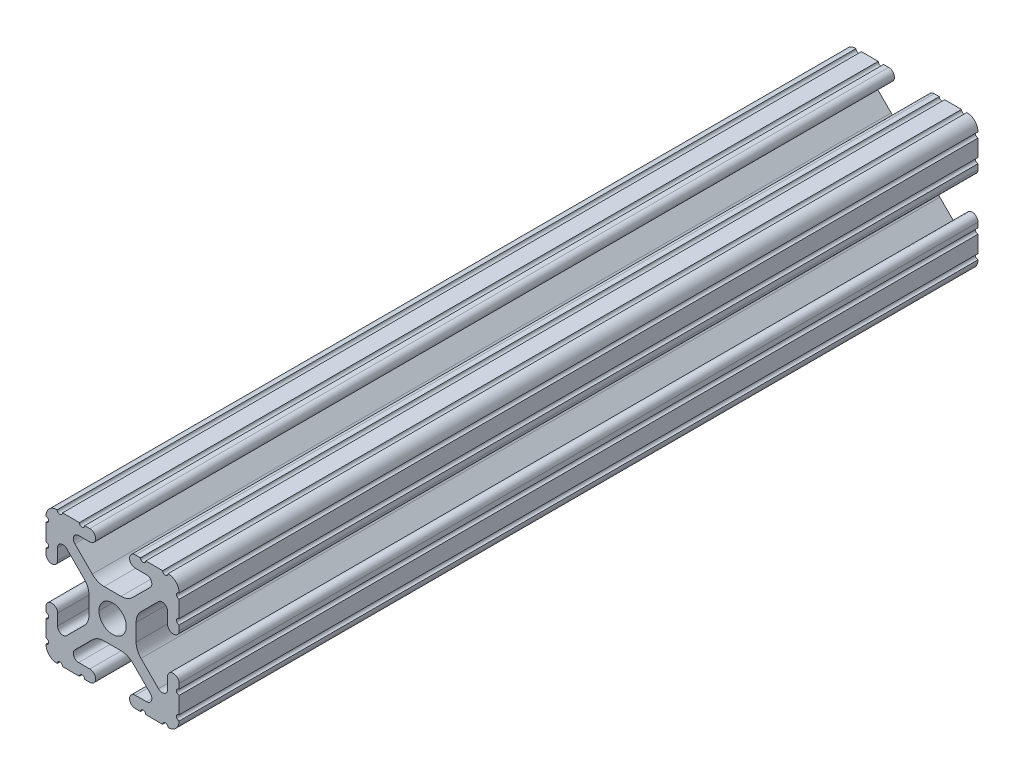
ISO-10303-21;
HEADER;
FILE_DESCRIPTION(('STEP AP214'),'2;1');
FILE_NAME('part.step','',(''),(''),'','','');
FILE_SCHEMA(('AUTOMOTIVE_DESIGN { 1 0 10303 214 1 1 1 1 }'));
ENDSEC;
DATA;
#1=APPLICATION_CONTEXT('core data for automotive mechanical design processes');
#2=APPLICATION_PROTOCOL_DEFINITION('international standard','automotive_design',2000,#1);
#3=PRODUCT_CONTEXT('',#1,'mechanical');
#4=PRODUCT('Part','Part','',(#3));
#5=PRODUCT_RELATED_PRODUCT_CATEGORY('part','',(#4));
#6=PRODUCT_DEFINITION_FORMATION('','',#4);
#7=PRODUCT_DEFINITION_CONTEXT('part definition',#1,'design');
#8=PRODUCT_DEFINITION('design','',#6,#7);
#9=PRODUCT_DEFINITION_SHAPE('','',#8);
#10=(LENGTH_UNIT() NAMED_UNIT(*) SI_UNIT(.MILLI.,.METRE.));
#11=(NAMED_UNIT(*) PLANE_ANGLE_UNIT() SI_UNIT($,.RADIAN.));
#12=(NAMED_UNIT(*) SI_UNIT($,.STERADIAN.) SOLID_ANGLE_UNIT());
#13=UNCERTAINTY_MEASURE_WITH_UNIT(LENGTH_MEASURE(1.E-05),#10,'distance_accuracy_value','');
#14=(GEOMETRIC_REPRESENTATION_CONTEXT(3) GLOBAL_UNCERTAINTY_ASSIGNED_CONTEXT((#13)) GLOBAL_UNIT_ASSIGNED_CONTEXT((#10,
#11,#12)) REPRESENTATION_CONTEXT('',''));
#15=CARTESIAN_POINT('',(0.,0.,0.));
#16=DIRECTION('',(0.,0.,1.));
#17=DIRECTION('',(1.,0.,0.));
#18=AXIS2_PLACEMENT_3D('',#15,#16,#17);
#19=CARTESIAN_POINT('',(-10.5917999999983,-10.5917999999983,-304.8));
#20=DIRECTION('',(0.,0.,-1.));
#21=DIRECTION('',(0.707106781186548,0.707106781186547,0.));
#22=AXIS2_PLACEMENT_3D('',#19,#20,#21);
#23=CYLINDRICAL_SURFACE('',#22,2.10820000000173);
#24=DIRECTION('',(0.,0.,1.));
#25=VECTOR('',#24,1.);
#26=CARTESIAN_POINT('',(-10.566399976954,-12.699846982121,-304.8));
#27=LINE('',#26,#25);
#28=CARTESIAN_POINT('',(-10.566399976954,-12.699846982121,-304.8));
#29=VERTEX_POINT('',#28);
#30=CARTESIAN_POINT('',(-10.566399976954,-12.699846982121,-152.4));
#31=VERTEX_POINT('',#30);
#32=EDGE_CURVE('E1006',#29,#31,#27,.T.);
#33=ORIENTED_EDGE('',*,*,#32,.T.);
#34=CARTESIAN_POINT('',(-10.5917999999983,-10.5917999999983,-152.4));
#35=DIRECTION('',(0.,0.,1.));
#36=DIRECTION('',(1.,0.,0.));
#37=AXIS2_PLACEMENT_3D('',#34,#35,#36);
#38=CIRCLE('',#37,2.10820000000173);
#39=CARTESIAN_POINT('',(-12.699846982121,-10.566399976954,-152.4));
#40=VERTEX_POINT('',#39);
#41=EDGE_CURVE('E1386',#31,#40,#38,.F.);
#42=ORIENTED_EDGE('',*,*,#41,.T.);
#43=DIRECTION('',(0.,0.,1.));
#44=VECTOR('',#43,1.);
#45=CARTESIAN_POINT('',(-12.699846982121,-10.566399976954,-304.8));
#46=LINE('',#45,#44);
#47=CARTESIAN_POINT('',(-12.699846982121,-10.566399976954,-304.8));
#48=VERTEX_POINT('',#47);
#49=EDGE_CURVE('E43',#48,#40,#46,.T.);
#50=ORIENTED_EDGE('',*,*,#49,.F.);
#51=CARTESIAN_POINT('',(-10.5917999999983,-10.5917999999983,-304.8));
#52=DIRECTION('',(0.,0.,1.));
#53=DIRECTION('',(1.,0.,0.));
#54=AXIS2_PLACEMENT_3D('',#51,#52,#53);
#55=CIRCLE('',#54,2.10820000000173);
#56=EDGE_CURVE('E1002',#48,#29,#55,.T.);
#57=ORIENTED_EDGE('',*,*,#56,.T.);
#58=EDGE_LOOP('',(#33,#42,#50,#57));
#59=FACE_BOUND('',#58,.T.);
#60=ADVANCED_FACE('F34',(#59),#23,.T.);
#61=CARTESIAN_POINT('',(-10.0583999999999,-12.6999999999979,-304.8));
#62=DIRECTION('',(0.,0.,-1.));
#63=DIRECTION('',(-0.000150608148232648,-0.999999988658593,0.));
#64=AXIS2_PLACEMENT_3D('',#61,#62,#63);
#65=CYLINDRICAL_SURFACE('',#64,0.507999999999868);
#66=CARTESIAN_POINT('',(-10.0583999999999,-12.6999999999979,-152.4));
#67=DIRECTION('',(0.,0.,1.));
#68=DIRECTION('',(1.,0.,0.));
#69=AXIS2_PLACEMENT_3D('',#66,#67,#68);
#70=CIRCLE('',#69,0.507999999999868);
#71=CARTESIAN_POINT('',(-9.5504,-12.6999999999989,-152.4));
#72=VERTEX_POINT('',#71);
#73=EDGE_CURVE('E58',#31,#72,#70,.F.);
#74=ORIENTED_EDGE('',*,*,#73,.F.);
#75=ORIENTED_EDGE('',*,*,#32,.F.);
#76=CARTESIAN_POINT('',(-10.0583999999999,-12.6999999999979,-304.8));
#77=DIRECTION('',(0.,0.,1.));
#78=DIRECTION('',(1.,0.,0.));
#79=AXIS2_PLACEMENT_3D('',#76,#77,#78);
#80=CIRCLE('',#79,0.507999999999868);
#81=CARTESIAN_POINT('',(-9.5504,-12.6999999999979,-304.8));
#82=VERTEX_POINT('',#81);
#83=EDGE_CURVE('E1015',#82,#29,#80,.T.);
#84=ORIENTED_EDGE('',*,*,#83,.F.);
#85=DIRECTION('',(0.,0.,1.));
#86=VECTOR('',#85,1.);
#87=CARTESIAN_POINT('',(-9.5504,-12.6999999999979,-304.8));
#88=LINE('',#87,#86);
#89=EDGE_CURVE('E1011',#82,#72,#88,.T.);
#90=ORIENTED_EDGE('',*,*,#89,.T.);
#91=EDGE_LOOP('',(#74,#75,#84,#90));
#92=FACE_BOUND('',#91,.T.);
#93=ADVANCED_FACE('F974',(#92),#65,.F.);
#94=CARTESIAN_POINT('',(0.,0.,-304.8));
#95=DIRECTION('',(0.,0.,-1.));
#96=DIRECTION('',(0.,1.,0.));
#97=AXIS2_PLACEMENT_3D('',#94,#95,#96);
#98=CYLINDRICAL_SURFACE('',#97,2.6035);
#99=CARTESIAN_POINT('',(0.,0.,-152.4));
#100=DIRECTION('',(0.,0.,1.));
#101=DIRECTION('',(1.,0.,0.));
#102=AXIS2_PLACEMENT_3D('',#99,#100,#101);
#103=CIRCLE('',#102,2.6035);
#104=CARTESIAN_POINT('',(2.6035,0.,-152.4));
#105=VERTEX_POINT('',#104);
#106=CARTESIAN_POINT('',(-2.6035,0.,-152.4));
#107=VERTEX_POINT('',#106);
#108=EDGE_CURVE('E50',#105,#107,#103,.F.);
#109=ORIENTED_EDGE('',*,*,#108,.F.);
#110=CARTESIAN_POINT('',(2.6035,0.,-152.4));
#111=DIRECTION('',(0.,0.,-1.));
#112=VECTOR('',#111,1.);
#113=LINE('',#110,#112);
#114=CARTESIAN_POINT('',(2.6035,0.,-304.8));
#115=VERTEX_POINT('',#114);
#116=EDGE_CURVE('E947',#105,#115,#113,.T.);
#117=ORIENTED_EDGE('',*,*,#116,.T.);
#118=CARTESIAN_POINT('',(0.,0.,-304.8));
#119=DIRECTION('',(0.,0.,1.));
#120=DIRECTION('',(1.,0.,0.));
#121=AXIS2_PLACEMENT_3D('',#118,#119,#120);
#122=CIRCLE('',#121,2.6035);
#123=CARTESIAN_POINT('',(-2.6035,0.,-304.8));
#124=VERTEX_POINT('',#123);
#125=EDGE_CURVE('E1381',#124,#115,#122,.T.);
#126=ORIENTED_EDGE('',*,*,#125,.F.);
#127=CARTESIAN_POINT('',(-2.6035,0.,-152.4));
#128=DIRECTION('',(0.,0.,-1.));
#129=VECTOR('',#128,1.);
#130=LINE('',#127,#129);
#131=EDGE_CURVE('E994',#107,#124,#130,.T.);
#132=ORIENTED_EDGE('',*,*,#131,.F.);
#133=EDGE_LOOP('',(#109,#117,#126,#132));
#134=FACE_BOUND('',#133,.T.);
#135=ADVANCED_FACE('F967',(#134),#98,.F.);
#136=CARTESIAN_POINT('',(0.,0.,-304.8));
#137=DIRECTION('',(0.,0.,-1.));
#138=DIRECTION('',(0.,-1.,0.));
#139=AXIS2_PLACEMENT_3D('',#136,#137,#138);
#140=CYLINDRICAL_SURFACE('',#139,2.6035);
#141=CARTESIAN_POINT('',(0.,0.,-152.4));
#142=DIRECTION('',(0.,0.,1.));
#143=DIRECTION('',(1.,0.,0.));
#144=AXIS2_PLACEMENT_3D('',#141,#142,#143);
#145=CIRCLE('',#144,2.6035);
#146=EDGE_CURVE('E566',#107,#105,#145,.F.);
#147=ORIENTED_EDGE('',*,*,#146,.F.);
#148=ORIENTED_EDGE('',*,*,#131,.T.);
#149=CARTESIAN_POINT('',(0.,0.,-304.8));
#150=DIRECTION('',(0.,0.,1.));
#151=DIRECTION('',(1.,0.,0.));
#152=AXIS2_PLACEMENT_3D('',#149,#150,#151);
#153=CIRCLE('',#152,2.6035);
#154=EDGE_CURVE('E1377',#115,#124,#153,.T.);
#155=ORIENTED_EDGE('',*,*,#154,.F.);
#156=ORIENTED_EDGE('',*,*,#116,.F.);
#157=EDGE_LOOP('',(#147,#148,#155,#156));
#158=FACE_BOUND('',#157,.T.);
#159=ADVANCED_FACE('F956',(#158),#140,.F.);
#160=CARTESIAN_POINT('',(-12.7,-6.3330836,-304.8));
#161=DIRECTION('',(-1.,0.,0.));
#162=DIRECTION('',(0.,0.,1.));
#163=AXIS2_PLACEMENT_3D('',#160,#161,#162);
#164=PLANE('',#163);
#165=DIRECTION('',(0.,0.,1.));
#166=VECTOR('',#165,1.);
#167=CARTESIAN_POINT('',(-12.7,-9.5504,-304.8));
#168=LINE('',#167,#166);
#169=CARTESIAN_POINT('',(-12.7,-9.5504,-304.8));
#170=VERTEX_POINT('',#169);
#171=CARTESIAN_POINT('',(-12.7,-9.5504,-152.4));
#172=VERTEX_POINT('',#171);
#173=EDGE_CURVE('E937',#170,#172,#168,.T.);
#174=ORIENTED_EDGE('',*,*,#173,.T.);
#175=DIRECTION('',(0.,1.,0.));
#176=VECTOR('',#175,1.);
#177=CARTESIAN_POINT('',(-12.7,-6.3330836,-152.4));
#178=LINE('',#177,#176);
#179=CARTESIAN_POINT('',(-12.7,-6.3330836,-152.4));
#180=VERTEX_POINT('',#179);
#181=EDGE_CURVE('E1394',#172,#180,#178,.T.);
#182=ORIENTED_EDGE('',*,*,#181,.T.);
#183=DIRECTION('',(0.,0.,1.));
#184=VECTOR('',#183,1.);
#185=CARTESIAN_POINT('',(-12.7,-6.3330836,-304.8));
#186=LINE('',#185,#184);
#187=CARTESIAN_POINT('',(-12.7,-6.3330836,-304.8));
#188=VERTEX_POINT('',#187);
#189=EDGE_CURVE('E942',#188,#180,#186,.T.);
#190=ORIENTED_EDGE('',*,*,#189,.F.);
#191=DIRECTION('',(0.,-1.,0.));
#192=VECTOR('',#191,1.);
#193=CARTESIAN_POINT('',(-12.7,-6.3330836,-304.8));
#194=LINE('',#193,#192);
#195=EDGE_CURVE('E1024',#188,#170,#194,.T.);
#196=ORIENTED_EDGE('',*,*,#195,.T.);
#197=EDGE_LOOP('',(#174,#182,#190,#196));
#198=FACE_BOUND('',#197,.T.);
#199=ADVANCED_FACE('F966',(#198),#164,.T.);
#200=CARTESIAN_POINT('',(-12.6999999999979,-10.0583999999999,-304.8));
#201=DIRECTION('',(0.,0.,-1.));
#202=DIRECTION('',(-0.999999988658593,-0.00015060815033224,0.));
#203=AXIS2_PLACEMENT_3D('',#200,#201,#202);
#204=CYLINDRICAL_SURFACE('',#203,0.50799999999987);
#205=CARTESIAN_POINT('',(-12.6999999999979,-10.0583999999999,-152.4));
#206=DIRECTION('',(0.,0.,1.));
#207=DIRECTION('',(1.,0.,0.));
#208=AXIS2_PLACEMENT_3D('',#205,#206,#207);
#209=CIRCLE('',#208,0.50799999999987);
#210=EDGE_CURVE('E1384',#172,#40,#209,.F.);
#211=ORIENTED_EDGE('',*,*,#210,.F.);
#212=ORIENTED_EDGE('',*,*,#173,.F.);
#213=CARTESIAN_POINT('',(-12.6999999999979,-10.0583999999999,-304.8));
#214=DIRECTION('',(0.,0.,1.));
#215=DIRECTION('',(1.,0.,0.));
#216=AXIS2_PLACEMENT_3D('',#213,#214,#215);
#217=CIRCLE('',#216,0.50799999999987);
#218=EDGE_CURVE('E1020',#48,#170,#217,.T.);
#219=ORIENTED_EDGE('',*,*,#218,.F.);
#220=ORIENTED_EDGE('',*,*,#49,.T.);
#221=EDGE_LOOP('',(#211,#212,#219,#220));
#222=FACE_BOUND('',#221,.T.);
#223=ADVANCED_FACE('F1871',(#222),#204,.F.);
#224=CARTESIAN_POINT('',(-12.699999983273,-5.8250836,-304.8));
#225=DIRECTION('',(0.,0.,-1.));
#226=DIRECTION('',(-1.,0.,0.));
#227=AXIS2_PLACEMENT_3D('',#224,#225,#226);
#228=CYLINDRICAL_SURFACE('',#227,0.508);
#229=CARTESIAN_POINT('',(-12.699999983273,-5.8250836,-152.4));
#230=DIRECTION('',(0.,0.,1.));
#231=DIRECTION('',(1.,0.,0.));
#232=AXIS2_PLACEMENT_3D('',#229,#230,#231);
#233=CIRCLE('',#232,0.508);
#234=CARTESIAN_POINT('',(-12.7,-5.3170836,-152.4));
#235=VERTEX_POINT('',#234);
#236=EDGE_CURVE('E1397',#235,#180,#233,.F.);
#237=ORIENTED_EDGE('',*,*,#236,.F.);
#238=DIRECTION('',(0.,0.,1.));
#239=VECTOR('',#238,1.);
#240=CARTESIAN_POINT('',(-12.7,-5.3170836,-304.8));
#241=LINE('',#240,#239);
#242=CARTESIAN_POINT('',(-12.7,-5.3170836,-304.8));
#243=VERTEX_POINT('',#242);
#244=EDGE_CURVE('E932',#243,#235,#241,.T.);
#245=ORIENTED_EDGE('',*,*,#244,.F.);
#246=CARTESIAN_POINT('',(-12.699999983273,-5.8250836,-304.8));
#247=DIRECTION('',(0.,0.,1.));
#248=DIRECTION('',(1.,0.,0.));
#249=AXIS2_PLACEMENT_3D('',#246,#247,#248);
#250=CIRCLE('',#249,0.508);
#251=EDGE_CURVE('E1029',#188,#243,#250,.T.);
#252=ORIENTED_EDGE('',*,*,#251,.F.);
#253=ORIENTED_EDGE('',*,*,#189,.T.);
#254=EDGE_LOOP('',(#237,#245,#252,#253));
#255=FACE_BOUND('',#254,.T.);
#256=ADVANCED_FACE('F1864',(#255),#228,.F.);
#257=CARTESIAN_POINT('',(-12.7,-4.3434,-304.8));
#258=DIRECTION('',(-1.,0.,0.));
#259=DIRECTION('',(0.,0.,1.));
#260=AXIS2_PLACEMENT_3D('',#257,#258,#259);
#261=PLANE('',#260);
#262=ORIENTED_EDGE('',*,*,#244,.T.);
#263=DIRECTION('',(0.,1.,0.));
#264=VECTOR('',#263,1.);
#265=CARTESIAN_POINT('',(-12.7,-4.3434,-152.4));
#266=LINE('',#265,#264);
#267=CARTESIAN_POINT('',(-12.7,-4.3434,-152.4));
#268=VERTEX_POINT('',#267);
#269=EDGE_CURVE('E1399',#235,#268,#266,.T.);
#270=ORIENTED_EDGE('',*,*,#269,.T.);
#271=DIRECTION('',(0.,0.,1.));
#272=VECTOR('',#271,1.);
#273=CARTESIAN_POINT('',(-12.7,-4.3434,-304.8));
#274=LINE('',#273,#272);
#275=CARTESIAN_POINT('',(-12.7,-4.3434,-304.8));
#276=VERTEX_POINT('',#275);
#277=EDGE_CURVE('E927',#276,#268,#274,.T.);
#278=ORIENTED_EDGE('',*,*,#277,.F.);
#279=DIRECTION('',(0.,-1.,0.));
#280=VECTOR('',#279,1.);
#281=CARTESIAN_POINT('',(-12.7,-4.3434,-304.8));
#282=LINE('',#281,#280);
#283=EDGE_CURVE('E1033',#276,#243,#282,.T.);
#284=ORIENTED_EDGE('',*,*,#283,.T.);
#285=EDGE_LOOP('',(#262,#270,#278,#284));
#286=FACE_BOUND('',#285,.T.);
#287=ADVANCED_FACE('F1860',(#286),#261,.T.);
#288=CARTESIAN_POINT('',(-11.5951,-4.3434,-304.8));
#289=DIRECTION('',(0.,0.,-1.));
#290=DIRECTION('',(0.,-1.,0.));
#291=AXIS2_PLACEMENT_3D('',#288,#289,#290);
#292=CYLINDRICAL_SURFACE('',#291,1.1049);
#293=ORIENTED_EDGE('',*,*,#277,.T.);
#294=CARTESIAN_POINT('',(-11.5951,-4.3434,-152.4));
#295=DIRECTION('',(0.,0.,1.));
#296=DIRECTION('',(1.,0.,0.));
#297=AXIS2_PLACEMENT_3D('',#294,#295,#296);
#298=CIRCLE('',#297,1.1049);
#299=CARTESIAN_POINT('',(-10.4902,-4.3434,-152.4));
#300=VERTEX_POINT('',#299);
#301=EDGE_CURVE('E1402',#268,#300,#298,.F.);
#302=ORIENTED_EDGE('',*,*,#301,.T.);
#303=DIRECTION('',(0.,0.,1.));
#304=VECTOR('',#303,1.);
#305=CARTESIAN_POINT('',(-10.4902,-4.3434,-304.8));
#306=LINE('',#305,#304);
#307=CARTESIAN_POINT('',(-10.4902,-4.3434,-304.8));
#308=VERTEX_POINT('',#307);
#309=EDGE_CURVE('E922',#308,#300,#306,.T.);
#310=ORIENTED_EDGE('',*,*,#309,.F.);
#311=CARTESIAN_POINT('',(-11.5951,-4.3434,-304.8));
#312=DIRECTION('',(0.,0.,1.));
#313=DIRECTION('',(1.,0.,0.));
#314=AXIS2_PLACEMENT_3D('',#311,#312,#313);
#315=CIRCLE('',#314,1.1049);
#316=EDGE_CURVE('E1038',#308,#276,#315,.T.);
#317=ORIENTED_EDGE('',*,*,#316,.T.);
#318=EDGE_LOOP('',(#293,#302,#310,#317));
#319=FACE_BOUND('',#318,.T.);
#320=ADVANCED_FACE('F1857',(#319),#292,.T.);
#321=CARTESIAN_POINT('',(-10.4902,-6.47479445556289,-304.8));
#322=DIRECTION('',(1.,0.,0.));
#323=DIRECTION('',(0.,0.,-1.));
#324=AXIS2_PLACEMENT_3D('',#321,#322,#323);
#325=PLANE('',#324);
#326=ORIENTED_EDGE('',*,*,#309,.T.);
#327=DIRECTION('',(0.,-1.,0.));
#328=VECTOR('',#327,1.);
#329=CARTESIAN_POINT('',(-10.4902,-6.47479445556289,-152.4));
#330=LINE('',#329,#328);
#331=CARTESIAN_POINT('',(-10.4902,-6.47479445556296,-152.4));
#332=VERTEX_POINT('',#331);
#333=EDGE_CURVE('E1405',#300,#332,#330,.T.);
#334=ORIENTED_EDGE('',*,*,#333,.T.);
#335=DIRECTION('',(0.,0.,1.));
#336=VECTOR('',#335,1.);
#337=CARTESIAN_POINT('',(-10.4902,-6.47479445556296,-304.8));
#338=LINE('',#337,#336);
#339=CARTESIAN_POINT('',(-10.4902,-6.47479445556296,-304.8));
#340=VERTEX_POINT('',#339);
#341=EDGE_CURVE('E917',#340,#332,#338,.T.);
#342=ORIENTED_EDGE('',*,*,#341,.F.);
#343=DIRECTION('',(0.,1.,0.));
#344=VECTOR('',#343,1.);
#345=CARTESIAN_POINT('',(-10.4902,-6.47479445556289,-304.8));
#346=LINE('',#345,#344);
#347=EDGE_CURVE('E1043',#340,#308,#346,.T.);
#348=ORIENTED_EDGE('',*,*,#347,.T.);
#349=EDGE_LOOP('',(#326,#334,#342,#348));
#350=FACE_BOUND('',#349,.T.);
#351=ADVANCED_FACE('F1854',(#350),#325,.T.);
#352=CARTESIAN_POINT('',(-9.47420000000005,-6.47479445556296,-304.8));
#353=DIRECTION('',(0.,0.,-1.));
#354=DIRECTION('',(0.382683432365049,0.923879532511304,0.));
#355=AXIS2_PLACEMENT_3D('',#352,#353,#354);
#356=CYLINDRICAL_SURFACE('',#355,1.01599999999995);
#357=CARTESIAN_POINT('',(-9.47420000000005,-6.47479445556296,-152.4));
#358=DIRECTION('',(0.,0.,1.));
#359=DIRECTION('',(1.,0.,0.));
#360=AXIS2_PLACEMENT_3D('',#357,#358,#359);
#361=CIRCLE('',#360,1.01599999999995);
#362=CARTESIAN_POINT('',(-8.75577951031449,-7.1932149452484,-152.4));
#363=VERTEX_POINT('',#362);
#364=EDGE_CURVE('E1408',#363,#332,#361,.F.);
#365=ORIENTED_EDGE('',*,*,#364,.F.);
#366=DIRECTION('',(0.,0.,1.));
#367=VECTOR('',#366,1.);
#368=CARTESIAN_POINT('',(-8.75577951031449,-7.1932149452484,-304.8));
#369=LINE('',#368,#367);
#370=CARTESIAN_POINT('',(-8.75577951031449,-7.1932149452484,-304.8));
#371=VERTEX_POINT('',#370);
#372=EDGE_CURVE('E912',#371,#363,#369,.T.);
#373=ORIENTED_EDGE('',*,*,#372,.F.);
#374=CARTESIAN_POINT('',(-9.47420000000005,-6.47479445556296,-304.8));
#375=DIRECTION('',(0.,0.,1.));
#376=DIRECTION('',(1.,0.,0.));
#377=AXIS2_PLACEMENT_3D('',#374,#375,#376);
#378=CIRCLE('',#377,1.01599999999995);
#379=EDGE_CURVE('E1048',#340,#371,#378,.T.);
#380=ORIENTED_EDGE('',*,*,#379,.F.);
#381=ORIENTED_EDGE('',*,*,#341,.T.);
#382=EDGE_LOOP('',(#365,#373,#380,#381));
#383=FACE_BOUND('',#382,.T.);
#384=ADVANCED_FACE('F1850',(#383),#356,.F.);
#385=CARTESIAN_POINT('',(-5.4257359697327,-3.86317140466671,-304.8));
#386=DIRECTION('',(-0.707106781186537,0.707106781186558,0.));
#387=DIRECTION('',(-0.707106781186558,-0.707106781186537,0.));
#388=AXIS2_PLACEMENT_3D('',#385,#386,#387);
#389=PLANE('',#388);
#390=ORIENTED_EDGE('',*,*,#372,.T.);
#391=DIRECTION('',(0.707106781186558,0.707106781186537,0.));
#392=VECTOR('',#391,1.);
#393=CARTESIAN_POINT('',(-5.4257359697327,-3.86317140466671,-152.4));
#394=LINE('',#393,#392);
#395=CARTESIAN_POINT('',(-5.4257359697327,-3.86317140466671,-152.4));
#396=VERTEX_POINT('',#395);
#397=EDGE_CURVE('E1410',#363,#396,#394,.T.);
#398=ORIENTED_EDGE('',*,*,#397,.T.);
#399=DIRECTION('',(0.,0.,1.));
#400=VECTOR('',#399,1.);
#401=CARTESIAN_POINT('',(-5.4257359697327,-3.86317140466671,-304.8));
#402=LINE('',#401,#400);
#403=CARTESIAN_POINT('',(-5.4257359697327,-3.86317140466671,-304.8));
#404=VERTEX_POINT('',#403);
#405=EDGE_CURVE('E907',#404,#396,#402,.T.);
#406=ORIENTED_EDGE('',*,*,#405,.F.);
#407=DIRECTION('',(-0.707106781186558,-0.707106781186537,0.));
#408=VECTOR('',#407,1.);
#409=CARTESIAN_POINT('',(-5.4257359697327,-3.86317140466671,-304.8));
#410=LINE('',#409,#408);
#411=EDGE_CURVE('E1052',#404,#371,#410,.T.);
#412=ORIENTED_EDGE('',*,*,#411,.T.);
#413=EDGE_LOOP('',(#390,#398,#406,#412));
#414=FACE_BOUND('',#413,.T.);
#415=ADVANCED_FACE('F1846',(#414),#389,.T.);
#416=CARTESIAN_POINT('',(-7.67080000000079,-1.6181073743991,-304.8));
#417=DIRECTION('',(0.,0.,-1.));
#418=DIRECTION('',(-0.923879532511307,0.38268343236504,0.));
#419=AXIS2_PLACEMENT_3D('',#416,#417,#418);
#420=CYLINDRICAL_SURFACE('',#419,3.17500000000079);
#421=CARTESIAN_POINT('',(-7.67080000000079,-1.6181073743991,-152.4));
#422=DIRECTION('',(0.,0.,1.));
#423=DIRECTION('',(1.,0.,0.));
#424=AXIS2_PLACEMENT_3D('',#421,#422,#423);
#425=CIRCLE('',#424,3.17500000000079);
#426=CARTESIAN_POINT('',(-4.4958,-1.6181073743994,-152.4));
#427=VERTEX_POINT('',#426);
#428=EDGE_CURVE('E1413',#427,#396,#425,.F.);
#429=ORIENTED_EDGE('',*,*,#428,.F.);
#430=DIRECTION('',(0.,0.,1.));
#431=VECTOR('',#430,1.);
#432=CARTESIAN_POINT('',(-4.4958,-1.6181073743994,-304.8));
#433=LINE('',#432,#431);
#434=CARTESIAN_POINT('',(-4.4958,-1.6181073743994,-304.8));
#435=VERTEX_POINT('',#434);
#436=EDGE_CURVE('E902',#435,#427,#433,.T.);
#437=ORIENTED_EDGE('',*,*,#436,.F.);
#438=CARTESIAN_POINT('',(-7.67080000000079,-1.6181073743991,-304.8));
#439=DIRECTION('',(0.,0.,1.));
#440=DIRECTION('',(1.,0.,0.));
#441=AXIS2_PLACEMENT_3D('',#438,#439,#440);
#442=CIRCLE('',#441,3.17500000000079);
#443=EDGE_CURVE('E1057',#404,#435,#442,.T.);
#444=ORIENTED_EDGE('',*,*,#443,.F.);
#445=ORIENTED_EDGE('',*,*,#405,.T.);
#446=EDGE_LOOP('',(#429,#437,#444,#445));
#447=FACE_BOUND('',#446,.T.);
#448=ADVANCED_FACE('F1842',(#447),#420,.F.);
#449=CARTESIAN_POINT('',(-4.4958,1.6181073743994,-304.8));
#450=DIRECTION('',(-1.,0.,0.));
#451=DIRECTION('',(0.,0.,1.));
#452=AXIS2_PLACEMENT_3D('',#449,#450,#451);
#453=PLANE('',#452);
#454=ORIENTED_EDGE('',*,*,#436,.T.);
#455=DIRECTION('',(0.,1.,0.));
#456=VECTOR('',#455,1.);
#457=CARTESIAN_POINT('',(-4.4958,1.6181073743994,-152.4));
#458=LINE('',#457,#456);
#459=CARTESIAN_POINT('',(-4.4958,1.61810737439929,-152.4));
#460=VERTEX_POINT('',#459);
#461=EDGE_CURVE('E1415',#427,#460,#458,.T.);
#462=ORIENTED_EDGE('',*,*,#461,.T.);
#463=DIRECTION('',(0.,0.,1.));
#464=VECTOR('',#463,1.);
#465=CARTESIAN_POINT('',(-4.4958,1.61810737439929,-304.8));
#466=LINE('',#465,#464);
#467=CARTESIAN_POINT('',(-4.4958,1.61810737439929,-304.8));
#468=VERTEX_POINT('',#467);
#469=EDGE_CURVE('E897',#468,#460,#466,.T.);
#470=ORIENTED_EDGE('',*,*,#469,.F.);
#471=DIRECTION('',(0.,-1.,0.));
#472=VECTOR('',#471,1.);
#473=CARTESIAN_POINT('',(-4.4958,1.6181073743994,-304.8));
#474=LINE('',#473,#472);
#475=EDGE_CURVE('E1061',#468,#435,#474,.T.);
#476=ORIENTED_EDGE('',*,*,#475,.T.);
#477=EDGE_LOOP('',(#454,#462,#470,#476));
#478=FACE_BOUND('',#477,.T.);
#479=ADVANCED_FACE('F1838',(#478),#453,.T.);
#480=CARTESIAN_POINT('',(-7.67080000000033,1.61810737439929,-304.8));
#481=DIRECTION('',(0.,0.,-1.));
#482=DIRECTION('',(-0.923879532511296,-0.382683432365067,0.));
#483=AXIS2_PLACEMENT_3D('',#480,#481,#482);
#484=CYLINDRICAL_SURFACE('',#483,3.17500000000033);
#485=CARTESIAN_POINT('',(-7.67080000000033,1.61810737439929,-152.4));
#486=DIRECTION('',(0.,0.,1.));
#487=DIRECTION('',(1.,0.,0.));
#488=AXIS2_PLACEMENT_3D('',#485,#486,#487);
#489=CIRCLE('',#488,3.17500000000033);
#490=CARTESIAN_POINT('',(-5.4257359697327,3.8631714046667,-152.4));
#491=VERTEX_POINT('',#490);
#492=EDGE_CURVE('E1418',#491,#460,#489,.F.);
#493=ORIENTED_EDGE('',*,*,#492,.F.);
#494=DIRECTION('',(0.,0.,1.));
#495=VECTOR('',#494,1.);
#496=CARTESIAN_POINT('',(-5.4257359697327,3.86317140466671,-304.8));
#497=LINE('',#496,#495);
#498=CARTESIAN_POINT('',(-5.4257359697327,3.86317140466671,-304.8));
#499=VERTEX_POINT('',#498);
#500=EDGE_CURVE('E892',#499,#491,#497,.T.);
#501=ORIENTED_EDGE('',*,*,#500,.F.);
#502=CARTESIAN_POINT('',(-7.67080000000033,1.61810737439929,-304.8));
#503=DIRECTION('',(0.,0.,1.));
#504=DIRECTION('',(1.,0.,0.));
#505=AXIS2_PLACEMENT_3D('',#502,#503,#504);
#506=CIRCLE('',#505,3.17500000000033);
#507=EDGE_CURVE('E1066',#468,#499,#506,.T.);
#508=ORIENTED_EDGE('',*,*,#507,.F.);
#509=ORIENTED_EDGE('',*,*,#469,.T.);
#510=EDGE_LOOP('',(#493,#501,#508,#509));
#511=FACE_BOUND('',#510,.T.);
#512=ADVANCED_FACE('F1834',(#511),#484,.F.);
#513=CARTESIAN_POINT('',(-8.75577951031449,7.1932149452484,-304.8));
#514=DIRECTION('',(-0.707106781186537,-0.707106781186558,0.));
#515=DIRECTION('',(0.707106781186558,-0.707106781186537,0.));
#516=AXIS2_PLACEMENT_3D('',#513,#514,#515);
#517=PLANE('',#516);
#518=ORIENTED_EDGE('',*,*,#500,.T.);
#519=DIRECTION('',(-0.707106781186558,0.707106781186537,0.));
#520=VECTOR('',#519,1.);
#521=CARTESIAN_POINT('',(-8.75577951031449,7.1932149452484,-152.4));
#522=LINE('',#521,#520);
#523=CARTESIAN_POINT('',(-8.75577951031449,7.1932149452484,-152.4));
#524=VERTEX_POINT('',#523);
#525=EDGE_CURVE('E1420',#491,#524,#522,.T.);
#526=ORIENTED_EDGE('',*,*,#525,.T.);
#527=DIRECTION('',(0.,0.,1.));
#528=VECTOR('',#527,1.);
#529=CARTESIAN_POINT('',(-8.75577951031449,7.1932149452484,-304.8));
#530=LINE('',#529,#528);
#531=CARTESIAN_POINT('',(-8.75577951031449,7.1932149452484,-304.8));
#532=VERTEX_POINT('',#531);
#533=EDGE_CURVE('E887',#532,#524,#530,.T.);
#534=ORIENTED_EDGE('',*,*,#533,.F.);
#535=DIRECTION('',(0.707106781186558,-0.707106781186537,0.));
#536=VECTOR('',#535,1.);
#537=CARTESIAN_POINT('',(-8.75577951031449,7.1932149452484,-304.8));
#538=LINE('',#537,#536);
#539=EDGE_CURVE('E1070',#532,#499,#538,.T.);
#540=ORIENTED_EDGE('',*,*,#539,.T.);
#541=EDGE_LOOP('',(#518,#526,#534,#540));
#542=FACE_BOUND('',#541,.T.);
#543=ADVANCED_FACE('F1830',(#542),#517,.T.);
#544=CARTESIAN_POINT('',(-9.47420000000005,6.47479445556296,-304.8));
#545=DIRECTION('',(0.,0.,-1.));
#546=DIRECTION('',(0.382683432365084,-0.923879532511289,0.));
#547=AXIS2_PLACEMENT_3D('',#544,#545,#546);
#548=CYLINDRICAL_SURFACE('',#547,1.01599999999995);
#549=CARTESIAN_POINT('',(-9.47420000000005,6.47479445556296,-152.4));
#550=DIRECTION('',(0.,0.,1.));
#551=DIRECTION('',(1.,0.,0.));
#552=AXIS2_PLACEMENT_3D('',#549,#550,#551);
#553=CIRCLE('',#552,1.01599999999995);
#554=CARTESIAN_POINT('',(-10.4902,6.47479445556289,-152.4));
#555=VERTEX_POINT('',#554);
#556=EDGE_CURVE('E1423',#555,#524,#553,.F.);
#557=ORIENTED_EDGE('',*,*,#556,.F.);
#558=DIRECTION('',(0.,0.,1.));
#559=VECTOR('',#558,1.);
#560=CARTESIAN_POINT('',(-10.4902,6.47479445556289,-304.8));
#561=LINE('',#560,#559);
#562=CARTESIAN_POINT('',(-10.4902,6.47479445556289,-304.8));
#563=VERTEX_POINT('',#562);
#564=EDGE_CURVE('E882',#563,#555,#561,.T.);
#565=ORIENTED_EDGE('',*,*,#564,.F.);
#566=CARTESIAN_POINT('',(-9.47420000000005,6.47479445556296,-304.8));
#567=DIRECTION('',(0.,0.,1.));
#568=DIRECTION('',(1.,0.,0.));
#569=AXIS2_PLACEMENT_3D('',#566,#567,#568);
#570=CIRCLE('',#569,1.01599999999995);
#571=EDGE_CURVE('E1075',#532,#563,#570,.T.);
#572=ORIENTED_EDGE('',*,*,#571,.F.);
#573=ORIENTED_EDGE('',*,*,#533,.T.);
#574=EDGE_LOOP('',(#557,#565,#572,#573));
#575=FACE_BOUND('',#574,.T.);
#576=ADVANCED_FACE('F1826',(#575),#548,.F.);
#577=CARTESIAN_POINT('',(-10.4902,4.3434,-304.8));
#578=DIRECTION('',(1.,0.,0.));
#579=DIRECTION('',(0.,0.,-1.));
#580=AXIS2_PLACEMENT_3D('',#577,#578,#579);
#581=PLANE('',#580);
#582=ORIENTED_EDGE('',*,*,#564,.T.);
#583=DIRECTION('',(0.,-1.,0.));
#584=VECTOR('',#583,1.);
#585=CARTESIAN_POINT('',(-10.4902,4.3434,-152.4));
#586=LINE('',#585,#584);
#587=CARTESIAN_POINT('',(-10.4902,4.34339999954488,-152.4));
#588=VERTEX_POINT('',#587);
#589=EDGE_CURVE('E1425',#555,#588,#586,.T.);
#590=ORIENTED_EDGE('',*,*,#589,.T.);
#591=DIRECTION('',(0.,0.,1.));
#592=VECTOR('',#591,1.);
#593=CARTESIAN_POINT('',(-10.4902,4.34339999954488,-304.8));
#594=LINE('',#593,#592);
#595=CARTESIAN_POINT('',(-10.4902,4.34339999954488,-304.8));
#596=VERTEX_POINT('',#595);
#597=EDGE_CURVE('E877',#596,#588,#594,.T.);
#598=ORIENTED_EDGE('',*,*,#597,.F.);
#599=DIRECTION('',(0.,1.,0.));
#600=VECTOR('',#599,1.);
#601=CARTESIAN_POINT('',(-10.4902,4.3434,-304.8));
#602=LINE('',#601,#600);
#603=EDGE_CURVE('E1079',#596,#563,#602,.T.);
#604=ORIENTED_EDGE('',*,*,#603,.T.);
#605=EDGE_LOOP('',(#582,#590,#598,#604));
#606=FACE_BOUND('',#605,.T.);
#607=ADVANCED_FACE('F1822',(#606),#581,.T.);
#608=CARTESIAN_POINT('',(-11.5951,4.3433999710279,-304.8));
#609=DIRECTION('',(0.,0.,-1.));
#610=DIRECTION('',(-2.12315225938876E-09,1.,0.));
#611=AXIS2_PLACEMENT_3D('',#608,#609,#610);
#612=CYLINDRICAL_SURFACE('',#611,1.1049);
#613=ORIENTED_EDGE('',*,*,#597,.T.);
#614=CARTESIAN_POINT('',(-11.5951,4.3433999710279,-152.4));
#615=DIRECTION('',(0.,0.,1.));
#616=DIRECTION('',(1.,0.,0.));
#617=AXIS2_PLACEMENT_3D('',#614,#615,#616);
#618=CIRCLE('',#617,1.1049);
#619=CARTESIAN_POINT('',(-12.7,4.3434,-152.4));
#620=VERTEX_POINT('',#619);
#621=EDGE_CURVE('E1428',#588,#620,#618,.F.);
#622=ORIENTED_EDGE('',*,*,#621,.T.);
#623=DIRECTION('',(0.,0.,1.));
#624=VECTOR('',#623,1.);
#625=CARTESIAN_POINT('',(-12.7,4.3434,-304.8));
#626=LINE('',#625,#624);
#627=CARTESIAN_POINT('',(-12.7,4.3434,-304.8));
#628=VERTEX_POINT('',#627);
#629=EDGE_CURVE('E872',#628,#620,#626,.T.);
#630=ORIENTED_EDGE('',*,*,#629,.F.);
#631=CARTESIAN_POINT('',(-11.5951,4.3433999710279,-304.8));
#632=DIRECTION('',(0.,0.,1.));
#633=DIRECTION('',(1.,0.,0.));
#634=AXIS2_PLACEMENT_3D('',#631,#632,#633);
#635=CIRCLE('',#634,1.1049);
#636=EDGE_CURVE('E1084',#628,#596,#635,.T.);
#637=ORIENTED_EDGE('',*,*,#636,.T.);
#638=EDGE_LOOP('',(#613,#622,#630,#637));
#639=FACE_BOUND('',#638,.T.);
#640=ADVANCED_FACE('F1819',(#639),#612,.T.);
#641=CARTESIAN_POINT('',(-12.7,5.3170836,-304.8));
#642=DIRECTION('',(-1.,0.,0.));
#643=DIRECTION('',(0.,0.,1.));
#644=AXIS2_PLACEMENT_3D('',#641,#642,#643);
#645=PLANE('',#644);
#646=ORIENTED_EDGE('',*,*,#629,.T.);
#647=DIRECTION('',(0.,1.,0.));
#648=VECTOR('',#647,1.);
#649=CARTESIAN_POINT('',(-12.7,5.3170836,-152.4));
#650=LINE('',#649,#648);
#651=CARTESIAN_POINT('',(-12.7,5.3170836,-152.4));
#652=VERTEX_POINT('',#651);
#653=EDGE_CURVE('E1431',#620,#652,#650,.T.);
#654=ORIENTED_EDGE('',*,*,#653,.T.);
#655=DIRECTION('',(0.,0.,1.));
#656=VECTOR('',#655,1.);
#657=CARTESIAN_POINT('',(-12.7,5.3170836,-304.8));
#658=LINE('',#657,#656);
#659=CARTESIAN_POINT('',(-12.7,5.3170836,-304.8));
#660=VERTEX_POINT('',#659);
#661=EDGE_CURVE('E867',#660,#652,#658,.T.);
#662=ORIENTED_EDGE('',*,*,#661,.F.);
#663=DIRECTION('',(0.,-1.,0.));
#664=VECTOR('',#663,1.);
#665=CARTESIAN_POINT('',(-12.7,5.3170836,-304.8));
#666=LINE('',#665,#664);
#667=EDGE_CURVE('E1089',#660,#628,#666,.T.);
#668=ORIENTED_EDGE('',*,*,#667,.T.);
#669=EDGE_LOOP('',(#646,#654,#662,#668));
#670=FACE_BOUND('',#669,.T.);
#671=ADVANCED_FACE('F1816',(#670),#645,.T.);
#672=CARTESIAN_POINT('',(-12.699999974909,5.8250836,-304.8));
#673=DIRECTION('',(0.,0.,-1.));
#674=DIRECTION('',(-1.,0.,0.));
#675=AXIS2_PLACEMENT_3D('',#672,#673,#674);
#676=CYLINDRICAL_SURFACE('',#675,0.508);
#677=CARTESIAN_POINT('',(-12.699999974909,5.8250836,-152.4));
#678=DIRECTION('',(0.,0.,1.));
#679=DIRECTION('',(1.,0.,0.));
#680=AXIS2_PLACEMENT_3D('',#677,#678,#679);
#681=CIRCLE('',#680,0.508);
#682=CARTESIAN_POINT('',(-12.7,6.3330836,-152.4));
#683=VERTEX_POINT('',#682);
#684=EDGE_CURVE('E1434',#683,#652,#681,.F.);
#685=ORIENTED_EDGE('',*,*,#684,.F.);
#686=DIRECTION('',(0.,0.,1.));
#687=VECTOR('',#686,1.);
#688=CARTESIAN_POINT('',(-12.7,6.3330836,-304.8));
#689=LINE('',#688,#687);
#690=CARTESIAN_POINT('',(-12.7,6.3330836,-304.8));
#691=VERTEX_POINT('',#690);
#692=EDGE_CURVE('E862',#691,#683,#689,.T.);
#693=ORIENTED_EDGE('',*,*,#692,.F.);
#694=CARTESIAN_POINT('',(-12.699999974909,5.8250836,-304.8));
#695=DIRECTION('',(0.,0.,1.));
#696=DIRECTION('',(1.,0.,0.));
#697=AXIS2_PLACEMENT_3D('',#694,#695,#696);
#698=CIRCLE('',#697,0.508);
#699=EDGE_CURVE('E1094',#660,#691,#698,.T.);
#700=ORIENTED_EDGE('',*,*,#699,.F.);
#701=ORIENTED_EDGE('',*,*,#661,.T.);
#702=EDGE_LOOP('',(#685,#693,#700,#701));
#703=FACE_BOUND('',#702,.T.);
#704=ADVANCED_FACE('F1812',(#703),#676,.F.);
#705=CARTESIAN_POINT('',(-12.7,9.5504,-304.8));
#706=DIRECTION('',(-1.,0.,0.));
#707=DIRECTION('',(0.,0.,1.));
#708=AXIS2_PLACEMENT_3D('',#705,#706,#707);
#709=PLANE('',#708);
#710=ORIENTED_EDGE('',*,*,#692,.T.);
#711=DIRECTION('',(0.,1.,0.));
#712=VECTOR('',#711,1.);
#713=CARTESIAN_POINT('',(-12.7,9.5504,-152.4));
#714=LINE('',#713,#712);
#715=CARTESIAN_POINT('',(-12.7000000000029,9.5504,-152.4));
#716=VERTEX_POINT('',#715);
#717=EDGE_CURVE('E1436',#683,#716,#714,.T.);
#718=ORIENTED_EDGE('',*,*,#717,.T.);
#719=DIRECTION('',(0.,0.,1.));
#720=VECTOR('',#719,1.);
#721=CARTESIAN_POINT('',(-12.7000000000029,9.5504,-304.8));
#722=LINE('',#721,#720);
#723=CARTESIAN_POINT('',(-12.7000000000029,9.5504,-304.8));
#724=VERTEX_POINT('',#723);
#725=EDGE_CURVE('E857',#724,#716,#722,.T.);
#726=ORIENTED_EDGE('',*,*,#725,.F.);
#727=DIRECTION('',(0.,-1.,0.));
#728=VECTOR('',#727,1.);
#729=CARTESIAN_POINT('',(-12.7,9.5504,-304.8));
#730=LINE('',#729,#728);
#731=EDGE_CURVE('E1098',#724,#691,#730,.T.);
#732=ORIENTED_EDGE('',*,*,#731,.T.);
#733=EDGE_LOOP('',(#710,#718,#726,#732));
#734=FACE_BOUND('',#733,.T.);
#735=ADVANCED_FACE('F1808',(#734),#709,.T.);
#736=CARTESIAN_POINT('',(-12.7000000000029,10.0583999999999,-304.8));
#737=DIRECTION('',(0.,0.,-1.));
#738=DIRECTION('',(-0.999999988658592,0.000150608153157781,0.));
#739=AXIS2_PLACEMENT_3D('',#736,#737,#738);
#740=CYLINDRICAL_SURFACE('',#739,0.50799999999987);
#741=CARTESIAN_POINT('',(-12.7000000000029,10.0583999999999,-152.4));
#742=DIRECTION('',(0.,0.,1.));
#743=DIRECTION('',(1.,0.,0.));
#744=AXIS2_PLACEMENT_3D('',#741,#742,#743);
#745=CIRCLE('',#744,0.50799999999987);
#746=CARTESIAN_POINT('',(-12.699846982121,10.566399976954,-152.4));
#747=VERTEX_POINT('',#746);
#748=EDGE_CURVE('E1439',#747,#716,#745,.F.);
#749=ORIENTED_EDGE('',*,*,#748,.F.);
#750=DIRECTION('',(0.,0.,1.));
#751=VECTOR('',#750,1.);
#752=CARTESIAN_POINT('',(-12.699846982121,10.566399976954,-304.8));
#753=LINE('',#752,#751);
#754=CARTESIAN_POINT('',(-12.699846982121,10.566399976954,-304.8));
#755=VERTEX_POINT('',#754);
#756=EDGE_CURVE('E852',#755,#747,#753,.T.);
#757=ORIENTED_EDGE('',*,*,#756,.F.);
#758=CARTESIAN_POINT('',(-12.7000000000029,10.0583999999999,-304.8));
#759=DIRECTION('',(0.,0.,1.));
#760=DIRECTION('',(1.,0.,0.));
#761=AXIS2_PLACEMENT_3D('',#758,#759,#760);
#762=CIRCLE('',#761,0.50799999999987);
#763=EDGE_CURVE('E1103',#724,#755,#762,.T.);
#764=ORIENTED_EDGE('',*,*,#763,.F.);
#765=ORIENTED_EDGE('',*,*,#725,.T.);
#766=EDGE_LOOP('',(#749,#757,#764,#765));
#767=FACE_BOUND('',#766,.T.);
#768=ADVANCED_FACE('F1804',(#767),#740,.F.);
#769=CARTESIAN_POINT('',(-10.5917999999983,10.5917999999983,-304.8));
#770=DIRECTION('',(0.,0.,-1.));
#771=DIRECTION('',(0.707106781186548,-0.707106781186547,0.));
#772=AXIS2_PLACEMENT_3D('',#769,#770,#771);
#773=CYLINDRICAL_SURFACE('',#772,2.10820000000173);
#774=ORIENTED_EDGE('',*,*,#756,.T.);
#775=CARTESIAN_POINT('',(-10.5917999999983,10.5917999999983,-152.4));
#776=DIRECTION('',(0.,0.,1.));
#777=DIRECTION('',(1.,0.,0.));
#778=AXIS2_PLACEMENT_3D('',#775,#776,#777);
#779=CIRCLE('',#778,2.10820000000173);
#780=CARTESIAN_POINT('',(-10.566399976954,12.6998469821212,-152.4));
#781=VERTEX_POINT('',#780);
#782=EDGE_CURVE('E1441',#747,#781,#779,.F.);
#783=ORIENTED_EDGE('',*,*,#782,.T.);
#784=DIRECTION('',(0.,0.,1.));
#785=VECTOR('',#784,1.);
#786=CARTESIAN_POINT('',(-10.566399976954,12.6998469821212,-304.8));
#787=LINE('',#786,#785);
#788=CARTESIAN_POINT('',(-10.566399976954,12.6998469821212,-304.8));
#789=VERTEX_POINT('',#788);
#790=EDGE_CURVE('E847',#789,#781,#787,.T.);
#791=ORIENTED_EDGE('',*,*,#790,.F.);
#792=CARTESIAN_POINT('',(-10.5917999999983,10.5917999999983,-304.8));
#793=DIRECTION('',(0.,0.,1.));
#794=DIRECTION('',(1.,0.,0.));
#795=AXIS2_PLACEMENT_3D('',#792,#793,#794);
#796=CIRCLE('',#795,2.10820000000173);
#797=EDGE_CURVE('E1107',#789,#755,#796,.T.);
#798=ORIENTED_EDGE('',*,*,#797,.T.);
#799=EDGE_LOOP('',(#774,#783,#791,#798));
#800=FACE_BOUND('',#799,.T.);
#801=ADVANCED_FACE('F1800',(#800),#773,.T.);
#802=CARTESIAN_POINT('',(-10.0583999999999,12.7000000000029,-304.8));
#803=DIRECTION('',(0.,0.,-1.));
#804=DIRECTION('',(-0.000150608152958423,0.999999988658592,0.));
#805=AXIS2_PLACEMENT_3D('',#802,#803,#804);
#806=CYLINDRICAL_SURFACE('',#805,0.50799999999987);
#807=CARTESIAN_POINT('',(-10.0583999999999,12.7000000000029,-152.4));
#808=DIRECTION('',(0.,0.,1.));
#809=DIRECTION('',(1.,0.,0.));
#810=AXIS2_PLACEMENT_3D('',#807,#808,#809);
#811=CIRCLE('',#810,0.50799999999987);
#812=CARTESIAN_POINT('',(-9.5504,12.7,-152.4));
#813=VERTEX_POINT('',#812);
#814=EDGE_CURVE('E1444',#813,#781,#811,.F.);
#815=ORIENTED_EDGE('',*,*,#814,.F.);
#816=DIRECTION('',(0.,0.,1.));
#817=VECTOR('',#816,1.);
#818=CARTESIAN_POINT('',(-9.5504,12.7,-304.8));
#819=LINE('',#818,#817);
#820=CARTESIAN_POINT('',(-9.5504,12.7,-304.8));
#821=VERTEX_POINT('',#820);
#822=EDGE_CURVE('E842',#821,#813,#819,.T.);
#823=ORIENTED_EDGE('',*,*,#822,.F.);
#824=CARTESIAN_POINT('',(-10.0583999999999,12.7000000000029,-304.8));
#825=DIRECTION('',(0.,0.,1.));
#826=DIRECTION('',(1.,0.,0.));
#827=AXIS2_PLACEMENT_3D('',#824,#825,#826);
#828=CIRCLE('',#827,0.50799999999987);
#829=EDGE_CURVE('E1112',#789,#821,#828,.T.);
#830=ORIENTED_EDGE('',*,*,#829,.F.);
#831=ORIENTED_EDGE('',*,*,#790,.T.);
#832=EDGE_LOOP('',(#815,#823,#830,#831));
#833=FACE_BOUND('',#832,.T.);
#834=ADVANCED_FACE('F1796',(#833),#806,.F.);
#835=CARTESIAN_POINT('',(-6.3330836,12.7,-304.8));
#836=DIRECTION('',(0.,1.,0.));
#837=DIRECTION('',(0.,0.,1.));
#838=AXIS2_PLACEMENT_3D('',#835,#836,#837);
#839=PLANE('',#838);
#840=ORIENTED_EDGE('',*,*,#822,.T.);
#841=DIRECTION('',(1.,0.,0.));
#842=VECTOR('',#841,1.);
#843=CARTESIAN_POINT('',(-6.3330836,12.7,-152.4));
#844=LINE('',#843,#842);
#845=CARTESIAN_POINT('',(-6.3330836,12.6999999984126,-152.4));
#846=VERTEX_POINT('',#845);
#847=EDGE_CURVE('E1446',#813,#846,#844,.T.);
#848=ORIENTED_EDGE('',*,*,#847,.T.);
#849=DIRECTION('',(0.,0.,1.));
#850=VECTOR('',#849,1.);
#851=CARTESIAN_POINT('',(-6.3330836,12.6999999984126,-304.8));
#852=LINE('',#851,#850);
#853=CARTESIAN_POINT('',(-6.3330836,12.6999999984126,-304.8));
#854=VERTEX_POINT('',#853);
#855=EDGE_CURVE('E837',#854,#846,#852,.T.);
#856=ORIENTED_EDGE('',*,*,#855,.F.);
#857=DIRECTION('',(-1.,0.,0.));
#858=VECTOR('',#857,1.);
#859=CARTESIAN_POINT('',(-6.3330836,12.7,-304.8));
#860=LINE('',#859,#858);
#861=EDGE_CURVE('E1116',#854,#821,#860,.T.);
#862=ORIENTED_EDGE('',*,*,#861,.T.);
#863=EDGE_LOOP('',(#840,#848,#856,#862));
#864=FACE_BOUND('',#863,.T.);
#865=ADVANCED_FACE('F1792',(#864),#839,.T.);
#866=CARTESIAN_POINT('',(-5.8250836,12.699999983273,-304.8));
#867=DIRECTION('',(0.,0.,-1.));
#868=DIRECTION('',(-4.53383591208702E-09,1.,0.));
#869=AXIS2_PLACEMENT_3D('',#866,#867,#868);
#870=CYLINDRICAL_SURFACE('',#869,0.508);
#871=CARTESIAN_POINT('',(-5.8250836,12.699999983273,-152.4));
#872=DIRECTION('',(0.,0.,1.));
#873=DIRECTION('',(1.,0.,0.));
#874=AXIS2_PLACEMENT_3D('',#871,#872,#873);
#875=CIRCLE('',#874,0.508);
#876=CARTESIAN_POINT('',(-5.3170836,12.7,-152.4));
#877=VERTEX_POINT('',#876);
#878=EDGE_CURVE('E1449',#877,#846,#875,.F.);
#879=ORIENTED_EDGE('',*,*,#878,.F.);
#880=DIRECTION('',(0.,0.,1.));
#881=VECTOR('',#880,1.);
#882=CARTESIAN_POINT('',(-5.3170836,12.7,-304.8));
#883=LINE('',#882,#881);
#884=CARTESIAN_POINT('',(-5.3170836,12.7,-304.8));
#885=VERTEX_POINT('',#884);
#886=EDGE_CURVE('E832',#885,#877,#883,.T.);
#887=ORIENTED_EDGE('',*,*,#886,.F.);
#888=CARTESIAN_POINT('',(-5.8250836,12.699999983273,-304.8));
#889=DIRECTION('',(0.,0.,1.));
#890=DIRECTION('',(1.,0.,0.));
#891=AXIS2_PLACEMENT_3D('',#888,#889,#890);
#892=CIRCLE('',#891,0.508);
#893=EDGE_CURVE('E1121',#854,#885,#892,.T.);
#894=ORIENTED_EDGE('',*,*,#893,.F.);
#895=ORIENTED_EDGE('',*,*,#855,.T.);
#896=EDGE_LOOP('',(#879,#887,#894,#895));
#897=FACE_BOUND('',#896,.T.);
#898=ADVANCED_FACE('F1788',(#897),#870,.F.);
#899=CARTESIAN_POINT('',(-4.3434,12.7,-304.8));
#900=DIRECTION('',(0.,1.,0.));
#901=DIRECTION('',(0.,0.,1.));
#902=AXIS2_PLACEMENT_3D('',#899,#900,#901);
#903=PLANE('',#902);
#904=ORIENTED_EDGE('',*,*,#886,.T.);
#905=DIRECTION('',(1.,0.,0.));
#906=VECTOR('',#905,1.);
#907=CARTESIAN_POINT('',(-4.3434,12.7,-152.4));
#908=LINE('',#907,#906);
#909=CARTESIAN_POINT('',(-4.3434,12.7,-152.4));
#910=VERTEX_POINT('',#909);
#911=EDGE_CURVE('E1451',#877,#910,#908,.T.);
#912=ORIENTED_EDGE('',*,*,#911,.T.);
#913=DIRECTION('',(0.,0.,1.));
#914=VECTOR('',#913,1.);
#915=CARTESIAN_POINT('',(-4.3434,12.7,-304.8));
#916=LINE('',#915,#914);
#917=CARTESIAN_POINT('',(-4.3434,12.7,-304.8));
#918=VERTEX_POINT('',#917);
#919=EDGE_CURVE('E827',#918,#910,#916,.T.);
#920=ORIENTED_EDGE('',*,*,#919,.F.);
#921=DIRECTION('',(-1.,0.,0.));
#922=VECTOR('',#921,1.);
#923=CARTESIAN_POINT('',(-4.3434,12.7,-304.8));
#924=LINE('',#923,#922);
#925=EDGE_CURVE('E1125',#918,#885,#924,.T.);
#926=ORIENTED_EDGE('',*,*,#925,.T.);
#927=EDGE_LOOP('',(#904,#912,#920,#926));
#928=FACE_BOUND('',#927,.T.);
#929=ADVANCED_FACE('F1784',(#928),#903,.T.);
#930=CARTESIAN_POINT('',(-4.3434,11.5951,-304.8));
#931=DIRECTION('',(0.,0.,-1.));
#932=DIRECTION('',(-1.,0.,0.));
#933=AXIS2_PLACEMENT_3D('',#930,#931,#932);
#934=CYLINDRICAL_SURFACE('',#933,1.1049);
#935=ORIENTED_EDGE('',*,*,#919,.T.);
#936=CARTESIAN_POINT('',(-4.3434,11.5951,-152.4));
#937=DIRECTION('',(0.,0.,1.));
#938=DIRECTION('',(1.,0.,0.));
#939=AXIS2_PLACEMENT_3D('',#936,#937,#938);
#940=CIRCLE('',#939,1.1049);
#941=CARTESIAN_POINT('',(-4.3434,10.4902,-152.4));
#942=VERTEX_POINT('',#941);
#943=EDGE_CURVE('E1454',#910,#942,#940,.F.);
#944=ORIENTED_EDGE('',*,*,#943,.T.);
#945=DIRECTION('',(0.,0.,1.));
#946=VECTOR('',#945,1.);
#947=CARTESIAN_POINT('',(-4.3434,10.4902,-304.8));
#948=LINE('',#947,#946);
#949=CARTESIAN_POINT('',(-4.3434,10.4902,-304.8));
#950=VERTEX_POINT('',#949);
#951=EDGE_CURVE('E822',#950,#942,#948,.T.);
#952=ORIENTED_EDGE('',*,*,#951,.F.);
#953=CARTESIAN_POINT('',(-4.3434,11.5951,-304.8));
#954=DIRECTION('',(0.,0.,1.));
#955=DIRECTION('',(1.,0.,0.));
#956=AXIS2_PLACEMENT_3D('',#953,#954,#955);
#957=CIRCLE('',#956,1.1049);
#958=EDGE_CURVE('E1130',#950,#918,#957,.T.);
#959=ORIENTED_EDGE('',*,*,#958,.T.);
#960=EDGE_LOOP('',(#935,#944,#952,#959));
#961=FACE_BOUND('',#960,.T.);
#962=ADVANCED_FACE('F1781',(#961),#934,.T.);
#963=CARTESIAN_POINT('',(-6.47479445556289,10.4902,-304.8));
#964=DIRECTION('',(0.,-1.,0.));
#965=DIRECTION('',(0.,0.,-1.));
#966=AXIS2_PLACEMENT_3D('',#963,#964,#965);
#967=PLANE('',#966);
#968=ORIENTED_EDGE('',*,*,#951,.T.);
#969=DIRECTION('',(-1.,0.,0.));
#970=VECTOR('',#969,1.);
#971=CARTESIAN_POINT('',(-6.47479445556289,10.4902,-152.4));
#972=LINE('',#971,#970);
#973=CARTESIAN_POINT('',(-6.47479445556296,10.4902,-152.4));
#974=VERTEX_POINT('',#973);
#975=EDGE_CURVE('E1457',#942,#974,#972,.T.);
#976=ORIENTED_EDGE('',*,*,#975,.T.);
#977=DIRECTION('',(0.,0.,1.));
#978=VECTOR('',#977,1.);
#979=CARTESIAN_POINT('',(-6.47479445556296,10.4902,-304.8));
#980=LINE('',#979,#978);
#981=CARTESIAN_POINT('',(-6.47479445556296,10.4902,-304.8));
#982=VERTEX_POINT('',#981);
#983=EDGE_CURVE('E817',#982,#974,#980,.T.);
#984=ORIENTED_EDGE('',*,*,#983,.F.);
#985=DIRECTION('',(1.,0.,0.));
#986=VECTOR('',#985,1.);
#987=CARTESIAN_POINT('',(-6.47479445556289,10.4902,-304.8));
#988=LINE('',#987,#986);
#989=EDGE_CURVE('E1135',#982,#950,#988,.T.);
#990=ORIENTED_EDGE('',*,*,#989,.T.);
#991=EDGE_LOOP('',(#968,#976,#984,#990));
#992=FACE_BOUND('',#991,.T.);
#993=ADVANCED_FACE('F1778',(#992),#967,.T.);
#994=CARTESIAN_POINT('',(-6.47479445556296,9.47420000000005,-304.8));
#995=DIRECTION('',(0.,0.,-1.));
#996=DIRECTION('',(0.923879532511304,-0.382683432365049,0.));
#997=AXIS2_PLACEMENT_3D('',#994,#995,#996);
#998=CYLINDRICAL_SURFACE('',#997,1.01599999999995);
#999=CARTESIAN_POINT('',(-6.47479445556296,9.47420000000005,-152.4));
#1000=DIRECTION('',(0.,0.,1.));
#1001=DIRECTION('',(1.,0.,0.));
#1002=AXIS2_PLACEMENT_3D('',#999,#1000,#1001);
#1003=CIRCLE('',#1002,1.01599999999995);
#1004=CARTESIAN_POINT('',(-7.1932149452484,8.75577951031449,-152.4));
#1005=VERTEX_POINT('',#1004);
#1006=EDGE_CURVE('E1460',#1005,#974,#1003,.F.);
#1007=ORIENTED_EDGE('',*,*,#1006,.F.);
#1008=DIRECTION('',(0.,0.,1.));
#1009=VECTOR('',#1008,1.);
#1010=CARTESIAN_POINT('',(-7.1932149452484,8.75577951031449,-304.8));
#1011=LINE('',#1010,#1009);
#1012=CARTESIAN_POINT('',(-7.1932149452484,8.75577951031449,-304.8));
#1013=VERTEX_POINT('',#1012);
#1014=EDGE_CURVE('E812',#1013,#1005,#1011,.T.);
#1015=ORIENTED_EDGE('',*,*,#1014,.F.);
#1016=CARTESIAN_POINT('',(-6.47479445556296,9.47420000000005,-304.8));
#1017=DIRECTION('',(0.,0.,1.));
#1018=DIRECTION('',(1.,0.,0.));
#1019=AXIS2_PLACEMENT_3D('',#1016,#1017,#1018);
#1020=CIRCLE('',#1019,1.01599999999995);
#1021=EDGE_CURVE('E1140',#982,#1013,#1020,.T.);
#1022=ORIENTED_EDGE('',*,*,#1021,.F.);
#1023=ORIENTED_EDGE('',*,*,#983,.T.);
#1024=EDGE_LOOP('',(#1007,#1015,#1022,#1023));
#1025=FACE_BOUND('',#1024,.T.);
#1026=ADVANCED_FACE('F1774',(#1025),#998,.F.);
#1027=CARTESIAN_POINT('',(-3.86317140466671,5.4257359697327,-304.8));
#1028=DIRECTION('',(0.707106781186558,0.707106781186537,0.));
#1029=DIRECTION('',(-0.707106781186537,0.707106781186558,0.));
#1030=AXIS2_PLACEMENT_3D('',#1027,#1028,#1029);
#1031=PLANE('',#1030);
#1032=ORIENTED_EDGE('',*,*,#1014,.T.);
#1033=DIRECTION('',(0.707106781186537,-0.707106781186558,0.));
#1034=VECTOR('',#1033,1.);
#1035=CARTESIAN_POINT('',(-3.86317140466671,5.4257359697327,-152.4));
#1036=LINE('',#1035,#1034);
#1037=CARTESIAN_POINT('',(-3.86317140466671,5.4257359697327,-152.4));
#1038=VERTEX_POINT('',#1037);
#1039=EDGE_CURVE('E1462',#1005,#1038,#1036,.T.);
#1040=ORIENTED_EDGE('',*,*,#1039,.T.);
#1041=DIRECTION('',(0.,0.,1.));
#1042=VECTOR('',#1041,1.);
#1043=CARTESIAN_POINT('',(-3.86317140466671,5.4257359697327,-304.8));
#1044=LINE('',#1043,#1042);
#1045=CARTESIAN_POINT('',(-3.86317140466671,5.4257359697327,-304.8));
#1046=VERTEX_POINT('',#1045);
#1047=EDGE_CURVE('E807',#1046,#1038,#1044,.T.);
#1048=ORIENTED_EDGE('',*,*,#1047,.F.);
#1049=DIRECTION('',(-0.707106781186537,0.707106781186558,0.));
#1050=VECTOR('',#1049,1.);
#1051=CARTESIAN_POINT('',(-3.86317140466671,5.4257359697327,-304.8));
#1052=LINE('',#1051,#1050);
#1053=EDGE_CURVE('E1144',#1046,#1013,#1052,.T.);
#1054=ORIENTED_EDGE('',*,*,#1053,.T.);
#1055=EDGE_LOOP('',(#1032,#1040,#1048,#1054));
#1056=FACE_BOUND('',#1055,.T.);
#1057=ADVANCED_FACE('F1770',(#1056),#1031,.T.);
#1058=CARTESIAN_POINT('',(-1.6181073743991,7.67080000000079,-304.8));
#1059=DIRECTION('',(0.,0.,-1.));
#1060=DIRECTION('',(0.382683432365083,0.923879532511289,0.));
#1061=AXIS2_PLACEMENT_3D('',#1058,#1059,#1060);
#1062=CYLINDRICAL_SURFACE('',#1061,3.17500000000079);
#1063=CARTESIAN_POINT('',(-1.6181073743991,7.67080000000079,-152.4));
#1064=DIRECTION('',(0.,0.,1.));
#1065=DIRECTION('',(1.,0.,0.));
#1066=AXIS2_PLACEMENT_3D('',#1063,#1064,#1065);
#1067=CIRCLE('',#1066,3.17500000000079);
#1068=CARTESIAN_POINT('',(-1.6181073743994,4.4958,-152.4));
#1069=VERTEX_POINT('',#1068);
#1070=EDGE_CURVE('E1465',#1069,#1038,#1067,.F.);
#1071=ORIENTED_EDGE('',*,*,#1070,.F.);
#1072=DIRECTION('',(0.,0.,1.));
#1073=VECTOR('',#1072,1.);
#1074=CARTESIAN_POINT('',(-1.6181073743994,4.4958,-304.8));
#1075=LINE('',#1074,#1073);
#1076=CARTESIAN_POINT('',(-1.6181073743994,4.4958,-304.8));
#1077=VERTEX_POINT('',#1076);
#1078=EDGE_CURVE('E802',#1077,#1069,#1075,.T.);
#1079=ORIENTED_EDGE('',*,*,#1078,.F.);
#1080=CARTESIAN_POINT('',(-1.6181073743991,7.67080000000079,-304.8));
#1081=DIRECTION('',(0.,0.,1.));
#1082=DIRECTION('',(1.,0.,0.));
#1083=AXIS2_PLACEMENT_3D('',#1080,#1081,#1082);
#1084=CIRCLE('',#1083,3.17500000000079);
#1085=EDGE_CURVE('E1149',#1046,#1077,#1084,.T.);
#1086=ORIENTED_EDGE('',*,*,#1085,.F.);
#1087=ORIENTED_EDGE('',*,*,#1047,.T.);
#1088=EDGE_LOOP('',(#1071,#1079,#1086,#1087));
#1089=FACE_BOUND('',#1088,.T.);
#1090=ADVANCED_FACE('F1766',(#1089),#1062,.F.);
#1091=CARTESIAN_POINT('',(1.6181073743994,4.4958,-304.8));
#1092=DIRECTION('',(0.,1.,0.));
#1093=DIRECTION('',(0.,0.,1.));
#1094=AXIS2_PLACEMENT_3D('',#1091,#1092,#1093);
#1095=PLANE('',#1094);
#1096=ORIENTED_EDGE('',*,*,#1078,.T.);
#1097=DIRECTION('',(1.,0.,0.));
#1098=VECTOR('',#1097,1.);
#1099=CARTESIAN_POINT('',(1.6181073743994,4.4958,-152.4));
#1100=LINE('',#1099,#1098);
#1101=CARTESIAN_POINT('',(1.61810737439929,4.4958,-152.4));
#1102=VERTEX_POINT('',#1101);
#1103=EDGE_CURVE('E1467',#1069,#1102,#1100,.T.);
#1104=ORIENTED_EDGE('',*,*,#1103,.T.);
#1105=DIRECTION('',(0.,0.,1.));
#1106=VECTOR('',#1105,1.);
#1107=CARTESIAN_POINT('',(1.61810737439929,4.4958,-304.8));
#1108=LINE('',#1107,#1106);
#1109=CARTESIAN_POINT('',(1.61810737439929,4.4958,-304.8));
#1110=VERTEX_POINT('',#1109);
#1111=EDGE_CURVE('E797',#1110,#1102,#1108,.T.);
#1112=ORIENTED_EDGE('',*,*,#1111,.F.);
#1113=DIRECTION('',(-1.,0.,0.));
#1114=VECTOR('',#1113,1.);
#1115=CARTESIAN_POINT('',(1.6181073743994,4.4958,-304.8));
#1116=LINE('',#1115,#1114);
#1117=EDGE_CURVE('E1153',#1110,#1077,#1116,.T.);
#1118=ORIENTED_EDGE('',*,*,#1117,.T.);
#1119=EDGE_LOOP('',(#1096,#1104,#1112,#1118));
#1120=FACE_BOUND('',#1119,.T.);
#1121=ADVANCED_FACE('F1762',(#1120),#1095,.T.);
#1122=CARTESIAN_POINT('',(1.61810737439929,7.67080000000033,-304.8));
#1123=DIRECTION('',(0.,0.,-1.));
#1124=DIRECTION('',(-0.382683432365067,0.923879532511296,0.));
#1125=AXIS2_PLACEMENT_3D('',#1122,#1123,#1124);
#1126=CYLINDRICAL_SURFACE('',#1125,3.17500000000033);
#1127=CARTESIAN_POINT('',(1.61810737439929,7.67080000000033,-152.4));
#1128=DIRECTION('',(0.,0.,1.));
#1129=DIRECTION('',(1.,0.,0.));
#1130=AXIS2_PLACEMENT_3D('',#1127,#1128,#1129);
#1131=CIRCLE('',#1130,3.17500000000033);
#1132=CARTESIAN_POINT('',(3.8631714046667,5.4257359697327,-152.4));
#1133=VERTEX_POINT('',#1132);
#1134=EDGE_CURVE('E1470',#1133,#1102,#1131,.F.);
#1135=ORIENTED_EDGE('',*,*,#1134,.F.);
#1136=DIRECTION('',(0.,0.,1.));
#1137=VECTOR('',#1136,1.);
#1138=CARTESIAN_POINT('',(3.86317140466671,5.4257359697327,-304.8));
#1139=LINE('',#1138,#1137);
#1140=CARTESIAN_POINT('',(3.86317140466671,5.4257359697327,-304.8));
#1141=VERTEX_POINT('',#1140);
#1142=EDGE_CURVE('E792',#1141,#1133,#1139,.T.);
#1143=ORIENTED_EDGE('',*,*,#1142,.F.);
#1144=CARTESIAN_POINT('',(1.61810737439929,7.67080000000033,-304.8));
#1145=DIRECTION('',(0.,0.,1.));
#1146=DIRECTION('',(1.,0.,0.));
#1147=AXIS2_PLACEMENT_3D('',#1144,#1145,#1146);
#1148=CIRCLE('',#1147,3.17500000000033);
#1149=EDGE_CURVE('E1158',#1110,#1141,#1148,.T.);
#1150=ORIENTED_EDGE('',*,*,#1149,.F.);
#1151=ORIENTED_EDGE('',*,*,#1111,.T.);
#1152=EDGE_LOOP('',(#1135,#1143,#1150,#1151));
#1153=FACE_BOUND('',#1152,.T.);
#1154=ADVANCED_FACE('F1758',(#1153),#1126,.F.);
#1155=CARTESIAN_POINT('',(7.1932149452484,8.75577951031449,-304.8));
#1156=DIRECTION('',(-0.707106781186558,0.707106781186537,0.));
#1157=DIRECTION('',(-0.707106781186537,-0.707106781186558,0.));
#1158=AXIS2_PLACEMENT_3D('',#1155,#1156,#1157);
#1159=PLANE('',#1158);
#1160=ORIENTED_EDGE('',*,*,#1142,.T.);
#1161=DIRECTION('',(0.707106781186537,0.707106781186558,0.));
#1162=VECTOR('',#1161,1.);
#1163=CARTESIAN_POINT('',(7.1932149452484,8.75577951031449,-152.4));
#1164=LINE('',#1163,#1162);
#1165=CARTESIAN_POINT('',(7.1932149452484,8.75577951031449,-152.4));
#1166=VERTEX_POINT('',#1165);
#1167=EDGE_CURVE('E1472',#1133,#1166,#1164,.T.);
#1168=ORIENTED_EDGE('',*,*,#1167,.T.);
#1169=DIRECTION('',(0.,0.,1.));
#1170=VECTOR('',#1169,1.);
#1171=CARTESIAN_POINT('',(7.1932149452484,8.75577951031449,-304.8));
#1172=LINE('',#1171,#1170);
#1173=CARTESIAN_POINT('',(7.1932149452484,8.75577951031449,-304.8));
#1174=VERTEX_POINT('',#1173);
#1175=EDGE_CURVE('E787',#1174,#1166,#1172,.T.);
#1176=ORIENTED_EDGE('',*,*,#1175,.F.);
#1177=DIRECTION('',(-0.707106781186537,-0.707106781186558,0.));
#1178=VECTOR('',#1177,1.);
#1179=CARTESIAN_POINT('',(7.1932149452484,8.75577951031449,-304.8));
#1180=LINE('',#1179,#1178);
#1181=EDGE_CURVE('E1162',#1174,#1141,#1180,.T.);
#1182=ORIENTED_EDGE('',*,*,#1181,.T.);
#1183=EDGE_LOOP('',(#1160,#1168,#1176,#1182));
#1184=FACE_BOUND('',#1183,.T.);
#1185=ADVANCED_FACE('F1754',(#1184),#1159,.T.);
#1186=CARTESIAN_POINT('',(6.47479445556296,9.47420000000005,-304.8));
#1187=DIRECTION('',(0.,0.,-1.));
#1188=DIRECTION('',(-0.923879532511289,-0.382683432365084,0.));
#1189=AXIS2_PLACEMENT_3D('',#1186,#1187,#1188);
#1190=CYLINDRICAL_SURFACE('',#1189,1.01599999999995);
#1191=CARTESIAN_POINT('',(6.47479445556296,9.47420000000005,-152.4));
#1192=DIRECTION('',(0.,0.,1.));
#1193=DIRECTION('',(1.,0.,0.));
#1194=AXIS2_PLACEMENT_3D('',#1191,#1192,#1193);
#1195=CIRCLE('',#1194,1.01599999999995);
#1196=CARTESIAN_POINT('',(6.47479445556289,10.4902,-152.4));
#1197=VERTEX_POINT('',#1196);
#1198=EDGE_CURVE('E1475',#1197,#1166,#1195,.F.);
#1199=ORIENTED_EDGE('',*,*,#1198,.F.);
#1200=DIRECTION('',(0.,0.,1.));
#1201=VECTOR('',#1200,1.);
#1202=CARTESIAN_POINT('',(6.47479445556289,10.4902,-304.8));
#1203=LINE('',#1202,#1201);
#1204=CARTESIAN_POINT('',(6.47479445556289,10.4902,-304.8));
#1205=VERTEX_POINT('',#1204);
#1206=EDGE_CURVE('E782',#1205,#1197,#1203,.T.);
#1207=ORIENTED_EDGE('',*,*,#1206,.F.);
#1208=CARTESIAN_POINT('',(6.47479445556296,9.47420000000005,-304.8));
#1209=DIRECTION('',(0.,0.,1.));
#1210=DIRECTION('',(1.,0.,0.));
#1211=AXIS2_PLACEMENT_3D('',#1208,#1209,#1210);
#1212=CIRCLE('',#1211,1.01599999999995);
#1213=EDGE_CURVE('E1167',#1174,#1205,#1212,.T.);
#1214=ORIENTED_EDGE('',*,*,#1213,.F.);
#1215=ORIENTED_EDGE('',*,*,#1175,.T.);
#1216=EDGE_LOOP('',(#1199,#1207,#1214,#1215));
#1217=FACE_BOUND('',#1216,.T.);
#1218=ADVANCED_FACE('F1750',(#1217),#1190,.F.);
#1219=CARTESIAN_POINT('',(4.3434,10.4902,-304.8));
#1220=DIRECTION('',(0.,-1.,0.));
#1221=DIRECTION('',(0.,0.,-1.));
#1222=AXIS2_PLACEMENT_3D('',#1219,#1220,#1221);
#1223=PLANE('',#1222);
#1224=ORIENTED_EDGE('',*,*,#1206,.T.);
#1225=DIRECTION('',(-1.,0.,0.));
#1226=VECTOR('',#1225,1.);
#1227=CARTESIAN_POINT('',(4.3434,10.4902,-152.4));
#1228=LINE('',#1227,#1226);
#1229=CARTESIAN_POINT('',(4.3434,10.4902,-152.4));
#1230=VERTEX_POINT('',#1229);
#1231=EDGE_CURVE('E1477',#1197,#1230,#1228,.T.);
#1232=ORIENTED_EDGE('',*,*,#1231,.T.);
#1233=DIRECTION('',(0.,0.,1.));
#1234=VECTOR('',#1233,1.);
#1235=CARTESIAN_POINT('',(4.3434,10.4902,-304.8));
#1236=LINE('',#1235,#1234);
#1237=CARTESIAN_POINT('',(4.3434,10.4902,-304.8));
#1238=VERTEX_POINT('',#1237);
#1239=EDGE_CURVE('E777',#1238,#1230,#1236,.T.);
#1240=ORIENTED_EDGE('',*,*,#1239,.F.);
#1241=DIRECTION('',(1.,0.,0.));
#1242=VECTOR('',#1241,1.);
#1243=CARTESIAN_POINT('',(4.3434,10.4902,-304.8));
#1244=LINE('',#1243,#1242);
#1245=EDGE_CURVE('E1171',#1238,#1205,#1244,.T.);
#1246=ORIENTED_EDGE('',*,*,#1245,.T.);
#1247=EDGE_LOOP('',(#1224,#1232,#1240,#1246));
#1248=FACE_BOUND('',#1247,.T.);
#1249=ADVANCED_FACE('F1746',(#1248),#1223,.T.);
#1250=CARTESIAN_POINT('',(4.3433999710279,11.5951,-304.8));
#1251=DIRECTION('',(0.,0.,-1.));
#1252=DIRECTION('',(1.,0.,0.));
#1253=AXIS2_PLACEMENT_3D('',#1250,#1251,#1252);
#1254=CYLINDRICAL_SURFACE('',#1253,1.1049);
#1255=ORIENTED_EDGE('',*,*,#1239,.T.);
#1256=CARTESIAN_POINT('',(4.3433999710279,11.5951,-152.4));
#1257=DIRECTION('',(0.,0.,1.));
#1258=DIRECTION('',(1.,0.,0.));
#1259=AXIS2_PLACEMENT_3D('',#1256,#1257,#1258);
#1260=CIRCLE('',#1259,1.1049);
#1261=CARTESIAN_POINT('',(4.3434,12.7,-152.4));
#1262=VERTEX_POINT('',#1261);
#1263=EDGE_CURVE('E1480',#1230,#1262,#1260,.F.);
#1264=ORIENTED_EDGE('',*,*,#1263,.T.);
#1265=DIRECTION('',(0.,0.,1.));
#1266=VECTOR('',#1265,1.);
#1267=CARTESIAN_POINT('',(4.3434,12.7,-304.8));
#1268=LINE('',#1267,#1266);
#1269=CARTESIAN_POINT('',(4.3434,12.7,-304.8));
#1270=VERTEX_POINT('',#1269);
#1271=EDGE_CURVE('E772',#1270,#1262,#1268,.T.);
#1272=ORIENTED_EDGE('',*,*,#1271,.F.);
#1273=CARTESIAN_POINT('',(4.3433999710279,11.5951,-304.8));
#1274=DIRECTION('',(0.,0.,1.));
#1275=DIRECTION('',(1.,0.,0.));
#1276=AXIS2_PLACEMENT_3D('',#1273,#1274,#1275);
#1277=CIRCLE('',#1276,1.1049);
#1278=EDGE_CURVE('E1176',#1270,#1238,#1277,.T.);
#1279=ORIENTED_EDGE('',*,*,#1278,.T.);
#1280=EDGE_LOOP('',(#1255,#1264,#1272,#1279));
#1281=FACE_BOUND('',#1280,.T.);
#1282=ADVANCED_FACE('F1743',(#1281),#1254,.T.);
#1283=CARTESIAN_POINT('',(5.3170836,12.7,-304.8));
#1284=DIRECTION('',(0.,1.,0.));
#1285=DIRECTION('',(0.,0.,1.));
#1286=AXIS2_PLACEMENT_3D('',#1283,#1284,#1285);
#1287=PLANE('',#1286);
#1288=ORIENTED_EDGE('',*,*,#1271,.T.);
#1289=DIRECTION('',(1.,0.,0.));
#1290=VECTOR('',#1289,1.);
#1291=CARTESIAN_POINT('',(5.3170836,12.7,-152.4));
#1292=LINE('',#1291,#1290);
#1293=CARTESIAN_POINT('',(5.3170836,12.7,-152.4));
#1294=VERTEX_POINT('',#1293);
#1295=EDGE_CURVE('E1483',#1262,#1294,#1292,.T.);
#1296=ORIENTED_EDGE('',*,*,#1295,.T.);
#1297=DIRECTION('',(0.,0.,1.));
#1298=VECTOR('',#1297,1.);
#1299=CARTESIAN_POINT('',(5.3170836,12.7,-304.8));
#1300=LINE('',#1299,#1298);
#1301=CARTESIAN_POINT('',(5.3170836,12.7,-304.8));
#1302=VERTEX_POINT('',#1301);
#1303=EDGE_CURVE('E767',#1302,#1294,#1300,.T.);
#1304=ORIENTED_EDGE('',*,*,#1303,.F.);
#1305=DIRECTION('',(-1.,0.,0.));
#1306=VECTOR('',#1305,1.);
#1307=CARTESIAN_POINT('',(5.3170836,12.7,-304.8));
#1308=LINE('',#1307,#1306);
#1309=EDGE_CURVE('E1181',#1302,#1270,#1308,.T.);
#1310=ORIENTED_EDGE('',*,*,#1309,.T.);
#1311=EDGE_LOOP('',(#1288,#1296,#1304,#1310));
#1312=FACE_BOUND('',#1311,.T.);
#1313=ADVANCED_FACE('F1740',(#1312),#1287,.T.);
#1314=CARTESIAN_POINT('',(5.8250836,12.7,-304.8));
#1315=DIRECTION('',(0.,0.,-1.));
#1316=DIRECTION('',(0.,1.,0.));
#1317=AXIS2_PLACEMENT_3D('',#1314,#1315,#1316);
#1318=CYLINDRICAL_SURFACE('',#1317,0.508);
#1319=CARTESIAN_POINT('',(5.8250836,12.7,-152.4));
#1320=DIRECTION('',(0.,0.,1.));
#1321=DIRECTION('',(1.,0.,0.));
#1322=AXIS2_PLACEMENT_3D('',#1319,#1320,#1321);
#1323=CIRCLE('',#1322,0.508);
#1324=CARTESIAN_POINT('',(6.3330836,12.7,-152.4));
#1325=VERTEX_POINT('',#1324);
#1326=EDGE_CURVE('E1486',#1325,#1294,#1323,.F.);
#1327=ORIENTED_EDGE('',*,*,#1326,.F.);
#1328=DIRECTION('',(0.,0.,1.));
#1329=VECTOR('',#1328,1.);
#1330=CARTESIAN_POINT('',(6.3330836,12.7,-304.8));
#1331=LINE('',#1330,#1329);
#1332=CARTESIAN_POINT('',(6.3330836,12.7,-304.8));
#1333=VERTEX_POINT('',#1332);
#1334=EDGE_CURVE('E762',#1333,#1325,#1331,.T.);
#1335=ORIENTED_EDGE('',*,*,#1334,.F.);
#1336=CARTESIAN_POINT('',(5.8250836,12.7,-304.8));
#1337=DIRECTION('',(0.,0.,1.));
#1338=DIRECTION('',(1.,0.,0.));
#1339=AXIS2_PLACEMENT_3D('',#1336,#1337,#1338);
#1340=CIRCLE('',#1339,0.508);
#1341=EDGE_CURVE('E1186',#1302,#1333,#1340,.T.);
#1342=ORIENTED_EDGE('',*,*,#1341,.F.);
#1343=ORIENTED_EDGE('',*,*,#1303,.T.);
#1344=EDGE_LOOP('',(#1327,#1335,#1342,#1343));
#1345=FACE_BOUND('',#1344,.T.);
#1346=ADVANCED_FACE('F1736',(#1345),#1318,.F.);
#1347=CARTESIAN_POINT('',(9.5504,12.7,-304.8));
#1348=DIRECTION('',(0.,1.,0.));
#1349=DIRECTION('',(0.,0.,1.));
#1350=AXIS2_PLACEMENT_3D('',#1347,#1348,#1349);
#1351=PLANE('',#1350);
#1352=ORIENTED_EDGE('',*,*,#1334,.T.);
#1353=DIRECTION('',(1.,0.,0.));
#1354=VECTOR('',#1353,1.);
#1355=CARTESIAN_POINT('',(9.5504,12.7,-152.4));
#1356=LINE('',#1355,#1354);
#1357=CARTESIAN_POINT('',(9.5504,12.6999999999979,-152.4));
#1358=VERTEX_POINT('',#1357);
#1359=EDGE_CURVE('E1488',#1325,#1358,#1356,.T.);
#1360=ORIENTED_EDGE('',*,*,#1359,.T.);
#1361=DIRECTION('',(0.,0.,1.));
#1362=VECTOR('',#1361,1.);
#1363=CARTESIAN_POINT('',(9.5504,12.6999999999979,-304.8));
#1364=LINE('',#1363,#1362);
#1365=CARTESIAN_POINT('',(9.5504,12.6999999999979,-304.8));
#1366=VERTEX_POINT('',#1365);
#1367=EDGE_CURVE('E757',#1366,#1358,#1364,.T.);
#1368=ORIENTED_EDGE('',*,*,#1367,.F.);
#1369=DIRECTION('',(-1.,0.,0.));
#1370=VECTOR('',#1369,1.);
#1371=CARTESIAN_POINT('',(9.5504,12.7,-304.8));
#1372=LINE('',#1371,#1370);
#1373=EDGE_CURVE('E1190',#1366,#1333,#1372,.T.);
#1374=ORIENTED_EDGE('',*,*,#1373,.T.);
#1375=EDGE_LOOP('',(#1352,#1360,#1368,#1374));
#1376=FACE_BOUND('',#1375,.T.);
#1377=ADVANCED_FACE('F1732',(#1376),#1351,.T.);
#1378=CARTESIAN_POINT('',(10.0583999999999,12.6999999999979,-304.8));
#1379=DIRECTION('',(0.,0.,-1.));
#1380=DIRECTION('',(0.00015060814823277,0.999999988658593,0.));
#1381=AXIS2_PLACEMENT_3D('',#1378,#1379,#1380);
#1382=CYLINDRICAL_SURFACE('',#1381,0.507999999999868);
#1383=CARTESIAN_POINT('',(10.0583999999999,12.6999999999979,-152.4));
#1384=DIRECTION('',(0.,0.,1.));
#1385=DIRECTION('',(1.,0.,0.));
#1386=AXIS2_PLACEMENT_3D('',#1383,#1384,#1385);
#1387=CIRCLE('',#1386,0.507999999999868);
#1388=CARTESIAN_POINT('',(10.566399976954,12.699846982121,-152.4));
#1389=VERTEX_POINT('',#1388);
#1390=EDGE_CURVE('E1491',#1389,#1358,#1387,.F.);
#1391=ORIENTED_EDGE('',*,*,#1390,.F.);
#1392=DIRECTION('',(0.,0.,1.));
#1393=VECTOR('',#1392,1.);
#1394=CARTESIAN_POINT('',(10.566399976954,12.699846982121,-304.8));
#1395=LINE('',#1394,#1393);
#1396=CARTESIAN_POINT('',(10.566399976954,12.699846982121,-304.8));
#1397=VERTEX_POINT('',#1396);
#1398=EDGE_CURVE('E752',#1397,#1389,#1395,.T.);
#1399=ORIENTED_EDGE('',*,*,#1398,.F.);
#1400=CARTESIAN_POINT('',(10.0583999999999,12.6999999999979,-304.8));
#1401=DIRECTION('',(0.,0.,1.));
#1402=DIRECTION('',(1.,0.,0.));
#1403=AXIS2_PLACEMENT_3D('',#1400,#1401,#1402);
#1404=CIRCLE('',#1403,0.507999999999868);
#1405=EDGE_CURVE('E1195',#1366,#1397,#1404,.T.);
#1406=ORIENTED_EDGE('',*,*,#1405,.F.);
#1407=ORIENTED_EDGE('',*,*,#1367,.T.);
#1408=EDGE_LOOP('',(#1391,#1399,#1406,#1407));
#1409=FACE_BOUND('',#1408,.T.);
#1410=ADVANCED_FACE('F1728',(#1409),#1382,.F.);
#1411=CARTESIAN_POINT('',(10.5917999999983,10.5917999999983,-304.8));
#1412=DIRECTION('',(0.,0.,-1.));
#1413=DIRECTION('',(-0.707106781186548,-0.707106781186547,0.));
#1414=AXIS2_PLACEMENT_3D('',#1411,#1412,#1413);
#1415=CYLINDRICAL_SURFACE('',#1414,2.10820000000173);
#1416=ORIENTED_EDGE('',*,*,#1398,.T.);
#1417=CARTESIAN_POINT('',(10.5917999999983,10.5917999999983,-152.4));
#1418=DIRECTION('',(0.,0.,1.));
#1419=DIRECTION('',(1.,0.,0.));
#1420=AXIS2_PLACEMENT_3D('',#1417,#1418,#1419);
#1421=CIRCLE('',#1420,2.10820000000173);
#1422=CARTESIAN_POINT('',(12.699846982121,10.566399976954,-152.4));
#1423=VERTEX_POINT('',#1422);
#1424=EDGE_CURVE('E1493',#1389,#1423,#1421,.F.);
#1425=ORIENTED_EDGE('',*,*,#1424,.T.);
#1426=DIRECTION('',(0.,0.,1.));
#1427=VECTOR('',#1426,1.);
#1428=CARTESIAN_POINT('',(12.699846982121,10.566399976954,-304.8));
#1429=LINE('',#1428,#1427);
#1430=CARTESIAN_POINT('',(12.699846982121,10.566399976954,-304.8));
#1431=VERTEX_POINT('',#1430);
#1432=EDGE_CURVE('E747',#1431,#1423,#1429,.T.);
#1433=ORIENTED_EDGE('',*,*,#1432,.F.);
#1434=CARTESIAN_POINT('',(10.5917999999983,10.5917999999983,-304.8));
#1435=DIRECTION('',(0.,0.,1.));
#1436=DIRECTION('',(1.,0.,0.));
#1437=AXIS2_PLACEMENT_3D('',#1434,#1435,#1436);
#1438=CIRCLE('',#1437,2.10820000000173);
#1439=EDGE_CURVE('E1199',#1431,#1397,#1438,.T.);
#1440=ORIENTED_EDGE('',*,*,#1439,.T.);
#1441=EDGE_LOOP('',(#1416,#1425,#1433,#1440));
#1442=FACE_BOUND('',#1441,.T.);
#1443=ADVANCED_FACE('F1724',(#1442),#1415,.T.);
#1444=CARTESIAN_POINT('',(12.7000000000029,10.0583999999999,-304.8));
#1445=DIRECTION('',(0.,0.,-1.));
#1446=DIRECTION('',(0.999999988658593,0.000150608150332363,0.));
#1447=AXIS2_PLACEMENT_3D('',#1444,#1445,#1446);
#1448=CYLINDRICAL_SURFACE('',#1447,0.50799999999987);
#1449=CARTESIAN_POINT('',(12.7000000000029,10.0583999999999,-152.4));
#1450=DIRECTION('',(0.,0.,1.));
#1451=DIRECTION('',(1.,0.,0.));
#1452=AXIS2_PLACEMENT_3D('',#1449,#1450,#1451);
#1453=CIRCLE('',#1452,0.50799999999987);
#1454=CARTESIAN_POINT('',(12.7,9.5504,-152.4));
#1455=VERTEX_POINT('',#1454);
#1456=EDGE_CURVE('E1496',#1455,#1423,#1453,.F.);
#1457=ORIENTED_EDGE('',*,*,#1456,.F.);
#1458=DIRECTION('',(0.,0.,1.));
#1459=VECTOR('',#1458,1.);
#1460=CARTESIAN_POINT('',(12.7,9.5504,-304.8));
#1461=LINE('',#1460,#1459);
#1462=CARTESIAN_POINT('',(12.7,9.5504,-304.8));
#1463=VERTEX_POINT('',#1462);
#1464=EDGE_CURVE('E742',#1463,#1455,#1461,.T.);
#1465=ORIENTED_EDGE('',*,*,#1464,.F.);
#1466=CARTESIAN_POINT('',(12.7000000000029,10.0583999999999,-304.8));
#1467=DIRECTION('',(0.,0.,1.));
#1468=DIRECTION('',(1.,0.,0.));
#1469=AXIS2_PLACEMENT_3D('',#1466,#1467,#1468);
#1470=CIRCLE('',#1469,0.50799999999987);
#1471=EDGE_CURVE('E1204',#1431,#1463,#1470,.T.);
#1472=ORIENTED_EDGE('',*,*,#1471,.F.);
#1473=ORIENTED_EDGE('',*,*,#1432,.T.);
#1474=EDGE_LOOP('',(#1457,#1465,#1472,#1473));
#1475=FACE_BOUND('',#1474,.T.);
#1476=ADVANCED_FACE('F1720',(#1475),#1448,.F.);
#1477=CARTESIAN_POINT('',(12.7,6.3330836,-304.8));
#1478=DIRECTION('',(1.,0.,0.));
#1479=DIRECTION('',(0.,0.,-1.));
#1480=AXIS2_PLACEMENT_3D('',#1477,#1478,#1479);
#1481=PLANE('',#1480);
#1482=ORIENTED_EDGE('',*,*,#1464,.T.);
#1483=DIRECTION('',(0.,-1.,0.));
#1484=VECTOR('',#1483,1.);
#1485=CARTESIAN_POINT('',(12.7,6.3330836,-152.4));
#1486=LINE('',#1485,#1484);
#1487=CARTESIAN_POINT('',(12.7,6.3330836,-152.4));
#1488=VERTEX_POINT('',#1487);
#1489=EDGE_CURVE('E1498',#1455,#1488,#1486,.T.);
#1490=ORIENTED_EDGE('',*,*,#1489,.T.);
#1491=DIRECTION('',(0.,0.,1.));
#1492=VECTOR('',#1491,1.);
#1493=CARTESIAN_POINT('',(12.7,6.3330836,-304.8));
#1494=LINE('',#1493,#1492);
#1495=CARTESIAN_POINT('',(12.7,6.3330836,-304.8));
#1496=VERTEX_POINT('',#1495);
#1497=EDGE_CURVE('E737',#1496,#1488,#1494,.T.);
#1498=ORIENTED_EDGE('',*,*,#1497,.F.);
#1499=DIRECTION('',(0.,1.,0.));
#1500=VECTOR('',#1499,1.);
#1501=CARTESIAN_POINT('',(12.7,6.3330836,-304.8));
#1502=LINE('',#1501,#1500);
#1503=EDGE_CURVE('E1208',#1496,#1463,#1502,.T.);
#1504=ORIENTED_EDGE('',*,*,#1503,.T.);
#1505=EDGE_LOOP('',(#1482,#1490,#1498,#1504));
#1506=FACE_BOUND('',#1505,.T.);
#1507=ADVANCED_FACE('F1716',(#1506),#1481,.T.);
#1508=CARTESIAN_POINT('',(12.699999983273,5.8250836,-304.8));
#1509=DIRECTION('',(0.,0.,-1.));
#1510=DIRECTION('',(1.,0.,0.));
#1511=AXIS2_PLACEMENT_3D('',#1508,#1509,#1510);
#1512=CYLINDRICAL_SURFACE('',#1511,0.508);
#1513=CARTESIAN_POINT('',(12.699999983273,5.8250836,-152.4));
#1514=DIRECTION('',(0.,0.,1.));
#1515=DIRECTION('',(1.,0.,0.));
#1516=AXIS2_PLACEMENT_3D('',#1513,#1514,#1515);
#1517=CIRCLE('',#1516,0.508);
#1518=CARTESIAN_POINT('',(12.7,5.3170836,-152.4));
#1519=VERTEX_POINT('',#1518);
#1520=EDGE_CURVE('E1501',#1519,#1488,#1517,.F.);
#1521=ORIENTED_EDGE('',*,*,#1520,.F.);
#1522=DIRECTION('',(0.,0.,1.));
#1523=VECTOR('',#1522,1.);
#1524=CARTESIAN_POINT('',(12.7,5.3170836,-304.8));
#1525=LINE('',#1524,#1523);
#1526=CARTESIAN_POINT('',(12.7,5.3170836,-304.8));
#1527=VERTEX_POINT('',#1526);
#1528=EDGE_CURVE('E732',#1527,#1519,#1525,.T.);
#1529=ORIENTED_EDGE('',*,*,#1528,.F.);
#1530=CARTESIAN_POINT('',(12.699999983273,5.8250836,-304.8));
#1531=DIRECTION('',(0.,0.,1.));
#1532=DIRECTION('',(1.,0.,0.));
#1533=AXIS2_PLACEMENT_3D('',#1530,#1531,#1532);
#1534=CIRCLE('',#1533,0.508);
#1535=EDGE_CURVE('E1213',#1496,#1527,#1534,.T.);
#1536=ORIENTED_EDGE('',*,*,#1535,.F.);
#1537=ORIENTED_EDGE('',*,*,#1497,.T.);
#1538=EDGE_LOOP('',(#1521,#1529,#1536,#1537));
#1539=FACE_BOUND('',#1538,.T.);
#1540=ADVANCED_FACE('F1712',(#1539),#1512,.F.);
#1541=CARTESIAN_POINT('',(12.7,4.3434,-304.8));
#1542=DIRECTION('',(1.,0.,0.));
#1543=DIRECTION('',(0.,0.,-1.));
#1544=AXIS2_PLACEMENT_3D('',#1541,#1542,#1543);
#1545=PLANE('',#1544);
#1546=ORIENTED_EDGE('',*,*,#1528,.T.);
#1547=DIRECTION('',(0.,-1.,0.));
#1548=VECTOR('',#1547,1.);
#1549=CARTESIAN_POINT('',(12.7,4.3434,-152.4));
#1550=LINE('',#1549,#1548);
#1551=CARTESIAN_POINT('',(12.7,4.3434,-152.4));
#1552=VERTEX_POINT('',#1551);
#1553=EDGE_CURVE('E1503',#1519,#1552,#1550,.T.);
#1554=ORIENTED_EDGE('',*,*,#1553,.T.);
#1555=DIRECTION('',(0.,0.,1.));
#1556=VECTOR('',#1555,1.);
#1557=CARTESIAN_POINT('',(12.7,4.3434,-304.8));
#1558=LINE('',#1557,#1556);
#1559=CARTESIAN_POINT('',(12.7,4.3434,-304.8));
#1560=VERTEX_POINT('',#1559);
#1561=EDGE_CURVE('E727',#1560,#1552,#1558,.T.);
#1562=ORIENTED_EDGE('',*,*,#1561,.F.);
#1563=DIRECTION('',(0.,1.,0.));
#1564=VECTOR('',#1563,1.);
#1565=CARTESIAN_POINT('',(12.7,4.3434,-304.8));
#1566=LINE('',#1565,#1564);
#1567=EDGE_CURVE('E1217',#1560,#1527,#1566,.T.);
#1568=ORIENTED_EDGE('',*,*,#1567,.T.);
#1569=EDGE_LOOP('',(#1546,#1554,#1562,#1568));
#1570=FACE_BOUND('',#1569,.T.);
#1571=ADVANCED_FACE('F1708',(#1570),#1545,.T.);
#1572=CARTESIAN_POINT('',(11.5951,4.3434,-304.8));
#1573=DIRECTION('',(0.,0.,-1.));
#1574=DIRECTION('',(0.,1.,0.));
#1575=AXIS2_PLACEMENT_3D('',#1572,#1573,#1574);
#1576=CYLINDRICAL_SURFACE('',#1575,1.1049);
#1577=ORIENTED_EDGE('',*,*,#1561,.T.);
#1578=CARTESIAN_POINT('',(11.5951,4.3434,-152.4));
#1579=DIRECTION('',(0.,0.,1.));
#1580=DIRECTION('',(1.,0.,0.));
#1581=AXIS2_PLACEMENT_3D('',#1578,#1579,#1580);
#1582=CIRCLE('',#1581,1.1049);
#1583=CARTESIAN_POINT('',(10.4902,4.3434,-152.4));
#1584=VERTEX_POINT('',#1583);
#1585=EDGE_CURVE('E1506',#1552,#1584,#1582,.F.);
#1586=ORIENTED_EDGE('',*,*,#1585,.T.);
#1587=DIRECTION('',(0.,0.,1.));
#1588=VECTOR('',#1587,1.);
#1589=CARTESIAN_POINT('',(10.4902,4.3434,-304.8));
#1590=LINE('',#1589,#1588);
#1591=CARTESIAN_POINT('',(10.4902,4.3434,-304.8));
#1592=VERTEX_POINT('',#1591);
#1593=EDGE_CURVE('E722',#1592,#1584,#1590,.T.);
#1594=ORIENTED_EDGE('',*,*,#1593,.F.);
#1595=CARTESIAN_POINT('',(11.5951,4.3434,-304.8));
#1596=DIRECTION('',(0.,0.,1.));
#1597=DIRECTION('',(1.,0.,0.));
#1598=AXIS2_PLACEMENT_3D('',#1595,#1596,#1597);
#1599=CIRCLE('',#1598,1.1049);
#1600=EDGE_CURVE('E1222',#1592,#1560,#1599,.T.);
#1601=ORIENTED_EDGE('',*,*,#1600,.T.);
#1602=EDGE_LOOP('',(#1577,#1586,#1594,#1601));
#1603=FACE_BOUND('',#1602,.T.);
#1604=ADVANCED_FACE('F1705',(#1603),#1576,.T.);
#1605=CARTESIAN_POINT('',(10.4902,6.47479445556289,-304.8));
#1606=DIRECTION('',(-1.,0.,0.));
#1607=DIRECTION('',(0.,0.,1.));
#1608=AXIS2_PLACEMENT_3D('',#1605,#1606,#1607);
#1609=PLANE('',#1608);
#1610=ORIENTED_EDGE('',*,*,#1593,.T.);
#1611=DIRECTION('',(0.,1.,0.));
#1612=VECTOR('',#1611,1.);
#1613=CARTESIAN_POINT('',(10.4902,6.47479445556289,-152.4));
#1614=LINE('',#1613,#1612);
#1615=CARTESIAN_POINT('',(10.4902,6.47479445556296,-152.4));
#1616=VERTEX_POINT('',#1615);
#1617=EDGE_CURVE('E1509',#1584,#1616,#1614,.T.);
#1618=ORIENTED_EDGE('',*,*,#1617,.T.);
#1619=DIRECTION('',(0.,0.,1.));
#1620=VECTOR('',#1619,1.);
#1621=CARTESIAN_POINT('',(10.4902,6.47479445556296,-304.8));
#1622=LINE('',#1621,#1620);
#1623=CARTESIAN_POINT('',(10.4902,6.47479445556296,-304.8));
#1624=VERTEX_POINT('',#1623);
#1625=EDGE_CURVE('E717',#1624,#1616,#1622,.T.);
#1626=ORIENTED_EDGE('',*,*,#1625,.F.);
#1627=DIRECTION('',(0.,-1.,0.));
#1628=VECTOR('',#1627,1.);
#1629=CARTESIAN_POINT('',(10.4902,6.47479445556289,-304.8));
#1630=LINE('',#1629,#1628);
#1631=EDGE_CURVE('E1227',#1624,#1592,#1630,.T.);
#1632=ORIENTED_EDGE('',*,*,#1631,.T.);
#1633=EDGE_LOOP('',(#1610,#1618,#1626,#1632));
#1634=FACE_BOUND('',#1633,.T.);
#1635=ADVANCED_FACE('F1702',(#1634),#1609,.T.);
#1636=CARTESIAN_POINT('',(9.47420000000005,6.47479445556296,-304.8));
#1637=DIRECTION('',(0.,0.,-1.));
#1638=DIRECTION('',(-0.382683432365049,-0.923879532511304,0.));
#1639=AXIS2_PLACEMENT_3D('',#1636,#1637,#1638);
#1640=CYLINDRICAL_SURFACE('',#1639,1.01599999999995);
#1641=CARTESIAN_POINT('',(9.47420000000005,6.47479445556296,-152.4));
#1642=DIRECTION('',(0.,0.,1.));
#1643=DIRECTION('',(1.,0.,0.));
#1644=AXIS2_PLACEMENT_3D('',#1641,#1642,#1643);
#1645=CIRCLE('',#1644,1.01599999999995);
#1646=CARTESIAN_POINT('',(8.75577951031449,7.1932149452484,-152.4));
#1647=VERTEX_POINT('',#1646);
#1648=EDGE_CURVE('E1512',#1647,#1616,#1645,.F.);
#1649=ORIENTED_EDGE('',*,*,#1648,.F.);
#1650=DIRECTION('',(0.,0.,1.));
#1651=VECTOR('',#1650,1.);
#1652=CARTESIAN_POINT('',(8.75577951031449,7.1932149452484,-304.8));
#1653=LINE('',#1652,#1651);
#1654=CARTESIAN_POINT('',(8.75577951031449,7.1932149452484,-304.8));
#1655=VERTEX_POINT('',#1654);
#1656=EDGE_CURVE('E712',#1655,#1647,#1653,.T.);
#1657=ORIENTED_EDGE('',*,*,#1656,.F.);
#1658=CARTESIAN_POINT('',(9.47420000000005,6.47479445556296,-304.8));
#1659=DIRECTION('',(0.,0.,1.));
#1660=DIRECTION('',(1.,0.,0.));
#1661=AXIS2_PLACEMENT_3D('',#1658,#1659,#1660);
#1662=CIRCLE('',#1661,1.01599999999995);
#1663=EDGE_CURVE('E1232',#1624,#1655,#1662,.T.);
#1664=ORIENTED_EDGE('',*,*,#1663,.F.);
#1665=ORIENTED_EDGE('',*,*,#1625,.T.);
#1666=EDGE_LOOP('',(#1649,#1657,#1664,#1665));
#1667=FACE_BOUND('',#1666,.T.);
#1668=ADVANCED_FACE('F1698',(#1667),#1640,.F.);
#1669=CARTESIAN_POINT('',(5.4257359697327,3.86317140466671,-304.8));
#1670=DIRECTION('',(0.707106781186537,-0.707106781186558,0.));
#1671=DIRECTION('',(0.707106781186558,0.707106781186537,0.));
#1672=AXIS2_PLACEMENT_3D('',#1669,#1670,#1671);
#1673=PLANE('',#1672);
#1674=ORIENTED_EDGE('',*,*,#1656,.T.);
#1675=DIRECTION('',(-0.707106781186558,-0.707106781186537,0.));
#1676=VECTOR('',#1675,1.);
#1677=CARTESIAN_POINT('',(5.4257359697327,3.86317140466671,-152.4));
#1678=LINE('',#1677,#1676);
#1679=CARTESIAN_POINT('',(5.4257359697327,3.86317140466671,-152.4));
#1680=VERTEX_POINT('',#1679);
#1681=EDGE_CURVE('E1514',#1647,#1680,#1678,.T.);
#1682=ORIENTED_EDGE('',*,*,#1681,.T.);
#1683=DIRECTION('',(0.,0.,1.));
#1684=VECTOR('',#1683,1.);
#1685=CARTESIAN_POINT('',(5.4257359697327,3.86317140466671,-304.8));
#1686=LINE('',#1685,#1684);
#1687=CARTESIAN_POINT('',(5.4257359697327,3.86317140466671,-304.8));
#1688=VERTEX_POINT('',#1687);
#1689=EDGE_CURVE('E707',#1688,#1680,#1686,.T.);
#1690=ORIENTED_EDGE('',*,*,#1689,.F.);
#1691=DIRECTION('',(0.707106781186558,0.707106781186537,0.));
#1692=VECTOR('',#1691,1.);
#1693=CARTESIAN_POINT('',(5.4257359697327,3.86317140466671,-304.8));
#1694=LINE('',#1693,#1692);
#1695=EDGE_CURVE('E1236',#1688,#1655,#1694,.T.);
#1696=ORIENTED_EDGE('',*,*,#1695,.T.);
#1697=EDGE_LOOP('',(#1674,#1682,#1690,#1696));
#1698=FACE_BOUND('',#1697,.T.);
#1699=ADVANCED_FACE('F1694',(#1698),#1673,.T.);
#1700=CARTESIAN_POINT('',(7.67080000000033,1.61810737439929,-304.8));
#1701=DIRECTION('',(0.,0.,-1.));
#1702=DIRECTION('',(0.92387953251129,-0.382683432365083,0.));
#1703=AXIS2_PLACEMENT_3D('',#1700,#1701,#1702);
#1704=CYLINDRICAL_SURFACE('',#1703,3.1750000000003);
#1705=CARTESIAN_POINT('',(7.67080000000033,1.61810737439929,-152.4));
#1706=DIRECTION('',(0.,0.,1.));
#1707=DIRECTION('',(1.,0.,0.));
#1708=AXIS2_PLACEMENT_3D('',#1705,#1706,#1707);
#1709=CIRCLE('',#1708,3.1750000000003);
#1710=CARTESIAN_POINT('',(4.4958,1.6181073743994,-152.4));
#1711=VERTEX_POINT('',#1710);
#1712=EDGE_CURVE('E1517',#1711,#1680,#1709,.F.);
#1713=ORIENTED_EDGE('',*,*,#1712,.F.);
#1714=DIRECTION('',(0.,0.,1.));
#1715=VECTOR('',#1714,1.);
#1716=CARTESIAN_POINT('',(4.4958,1.6181073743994,-304.8));
#1717=LINE('',#1716,#1715);
#1718=CARTESIAN_POINT('',(4.4958,1.6181073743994,-304.8));
#1719=VERTEX_POINT('',#1718);
#1720=EDGE_CURVE('E702',#1719,#1711,#1717,.T.);
#1721=ORIENTED_EDGE('',*,*,#1720,.F.);
#1722=CARTESIAN_POINT('',(7.67080000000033,1.61810737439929,-304.8));
#1723=DIRECTION('',(0.,0.,1.));
#1724=DIRECTION('',(1.,0.,0.));
#1725=AXIS2_PLACEMENT_3D('',#1722,#1723,#1724);
#1726=CIRCLE('',#1725,3.1750000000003);
#1727=EDGE_CURVE('E1241',#1688,#1719,#1726,.T.);
#1728=ORIENTED_EDGE('',*,*,#1727,.F.);
#1729=ORIENTED_EDGE('',*,*,#1689,.T.);
#1730=EDGE_LOOP('',(#1713,#1721,#1728,#1729));
#1731=FACE_BOUND('',#1730,.T.);
#1732=ADVANCED_FACE('F1690',(#1731),#1704,.F.);
#1733=CARTESIAN_POINT('',(4.4958,-1.6181073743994,-304.8));
#1734=DIRECTION('',(1.,0.,0.));
#1735=DIRECTION('',(0.,0.,-1.));
#1736=AXIS2_PLACEMENT_3D('',#1733,#1734,#1735);
#1737=PLANE('',#1736);
#1738=ORIENTED_EDGE('',*,*,#1720,.T.);
#1739=DIRECTION('',(0.,-1.,0.));
#1740=VECTOR('',#1739,1.);
#1741=CARTESIAN_POINT('',(4.4958,-1.6181073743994,-152.4));
#1742=LINE('',#1741,#1740);
#1743=CARTESIAN_POINT('',(4.4958,-1.61810737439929,-152.4));
#1744=VERTEX_POINT('',#1743);
#1745=EDGE_CURVE('E1519',#1711,#1744,#1742,.T.);
#1746=ORIENTED_EDGE('',*,*,#1745,.T.);
#1747=DIRECTION('',(0.,0.,1.));
#1748=VECTOR('',#1747,1.);
#1749=CARTESIAN_POINT('',(4.4958,-1.61810737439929,-304.8));
#1750=LINE('',#1749,#1748);
#1751=CARTESIAN_POINT('',(4.4958,-1.61810737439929,-304.8));
#1752=VERTEX_POINT('',#1751);
#1753=EDGE_CURVE('E697',#1752,#1744,#1750,.T.);
#1754=ORIENTED_EDGE('',*,*,#1753,.F.);
#1755=DIRECTION('',(0.,1.,0.));
#1756=VECTOR('',#1755,1.);
#1757=CARTESIAN_POINT('',(4.4958,-1.6181073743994,-304.8));
#1758=LINE('',#1757,#1756);
#1759=EDGE_CURVE('E1245',#1752,#1719,#1758,.T.);
#1760=ORIENTED_EDGE('',*,*,#1759,.T.);
#1761=EDGE_LOOP('',(#1738,#1746,#1754,#1760));
#1762=FACE_BOUND('',#1761,.T.);
#1763=ADVANCED_FACE('F1686',(#1762),#1737,.T.);
#1764=CARTESIAN_POINT('',(7.67080000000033,-1.61810737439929,-304.8));
#1765=DIRECTION('',(0.,0.,-1.));
#1766=DIRECTION('',(0.923879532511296,0.382683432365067,0.));
#1767=AXIS2_PLACEMENT_3D('',#1764,#1765,#1766);
#1768=CYLINDRICAL_SURFACE('',#1767,3.17500000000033);
#1769=CARTESIAN_POINT('',(7.67080000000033,-1.61810737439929,-152.4));
#1770=DIRECTION('',(0.,0.,1.));
#1771=DIRECTION('',(1.,0.,0.));
#1772=AXIS2_PLACEMENT_3D('',#1769,#1770,#1771);
#1773=CIRCLE('',#1772,3.17500000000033);
#1774=CARTESIAN_POINT('',(5.4257359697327,-3.8631714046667,-152.4));
#1775=VERTEX_POINT('',#1774);
#1776=EDGE_CURVE('E1522',#1775,#1744,#1773,.F.);
#1777=ORIENTED_EDGE('',*,*,#1776,.F.);
#1778=DIRECTION('',(0.,0.,1.));
#1779=VECTOR('',#1778,1.);
#1780=CARTESIAN_POINT('',(5.4257359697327,-3.86317140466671,-304.8));
#1781=LINE('',#1780,#1779);
#1782=CARTESIAN_POINT('',(5.4257359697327,-3.86317140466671,-304.8));
#1783=VERTEX_POINT('',#1782);
#1784=EDGE_CURVE('E692',#1783,#1775,#1781,.T.);
#1785=ORIENTED_EDGE('',*,*,#1784,.F.);
#1786=CARTESIAN_POINT('',(7.67080000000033,-1.61810737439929,-304.8));
#1787=DIRECTION('',(0.,0.,1.));
#1788=DIRECTION('',(1.,0.,0.));
#1789=AXIS2_PLACEMENT_3D('',#1786,#1787,#1788);
#1790=CIRCLE('',#1789,3.17500000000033);
#1791=EDGE_CURVE('E1250',#1752,#1783,#1790,.T.);
#1792=ORIENTED_EDGE('',*,*,#1791,.F.);
#1793=ORIENTED_EDGE('',*,*,#1753,.T.);
#1794=EDGE_LOOP('',(#1777,#1785,#1792,#1793));
#1795=FACE_BOUND('',#1794,.T.);
#1796=ADVANCED_FACE('F1682',(#1795),#1768,.F.);
#1797=CARTESIAN_POINT('',(8.75577951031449,-7.1932149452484,-304.8));
#1798=DIRECTION('',(0.707106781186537,0.707106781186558,0.));
#1799=DIRECTION('',(-0.707106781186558,0.707106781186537,0.));
#1800=AXIS2_PLACEMENT_3D('',#1797,#1798,#1799);
#1801=PLANE('',#1800);
#1802=ORIENTED_EDGE('',*,*,#1784,.T.);
#1803=DIRECTION('',(0.707106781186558,-0.707106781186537,0.));
#1804=VECTOR('',#1803,1.);
#1805=CARTESIAN_POINT('',(8.75577951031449,-7.1932149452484,-152.4));
#1806=LINE('',#1805,#1804);
#1807=CARTESIAN_POINT('',(8.75577951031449,-7.1932149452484,-152.4));
#1808=VERTEX_POINT('',#1807);
#1809=EDGE_CURVE('E1524',#1775,#1808,#1806,.T.);
#1810=ORIENTED_EDGE('',*,*,#1809,.T.);
#1811=DIRECTION('',(0.,0.,1.));
#1812=VECTOR('',#1811,1.);
#1813=CARTESIAN_POINT('',(8.75577951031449,-7.1932149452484,-304.8));
#1814=LINE('',#1813,#1812);
#1815=CARTESIAN_POINT('',(8.75577951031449,-7.1932149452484,-304.8));
#1816=VERTEX_POINT('',#1815);
#1817=EDGE_CURVE('E687',#1816,#1808,#1814,.T.);
#1818=ORIENTED_EDGE('',*,*,#1817,.F.);
#1819=DIRECTION('',(-0.707106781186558,0.707106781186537,0.));
#1820=VECTOR('',#1819,1.);
#1821=CARTESIAN_POINT('',(8.75577951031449,-7.1932149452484,-304.8));
#1822=LINE('',#1821,#1820);
#1823=EDGE_CURVE('E1254',#1816,#1783,#1822,.T.);
#1824=ORIENTED_EDGE('',*,*,#1823,.T.);
#1825=EDGE_LOOP('',(#1802,#1810,#1818,#1824));
#1826=FACE_BOUND('',#1825,.T.);
#1827=ADVANCED_FACE('F1678',(#1826),#1801,.T.);
#1828=CARTESIAN_POINT('',(9.47420000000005,-6.47479445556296,-304.8));
#1829=DIRECTION('',(0.,0.,-1.));
#1830=DIRECTION('',(-0.38268343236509,0.923879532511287,0.));
#1831=AXIS2_PLACEMENT_3D('',#1828,#1829,#1830);
#1832=CYLINDRICAL_SURFACE('',#1831,1.01599999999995);
#1833=CARTESIAN_POINT('',(9.47420000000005,-6.47479445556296,-152.4));
#1834=DIRECTION('',(0.,0.,1.));
#1835=DIRECTION('',(1.,0.,0.));
#1836=AXIS2_PLACEMENT_3D('',#1833,#1834,#1835);
#1837=CIRCLE('',#1836,1.01599999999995);
#1838=CARTESIAN_POINT('',(10.4902,-6.47479445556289,-152.4));
#1839=VERTEX_POINT('',#1838);
#1840=EDGE_CURVE('E1527',#1839,#1808,#1837,.F.);
#1841=ORIENTED_EDGE('',*,*,#1840,.F.);
#1842=DIRECTION('',(0.,0.,1.));
#1843=VECTOR('',#1842,1.);
#1844=CARTESIAN_POINT('',(10.4902,-6.47479445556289,-304.8));
#1845=LINE('',#1844,#1843);
#1846=CARTESIAN_POINT('',(10.4902,-6.47479445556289,-304.8));
#1847=VERTEX_POINT('',#1846);
#1848=EDGE_CURVE('E682',#1847,#1839,#1845,.T.);
#1849=ORIENTED_EDGE('',*,*,#1848,.F.);
#1850=CARTESIAN_POINT('',(9.47420000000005,-6.47479445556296,-304.8));
#1851=DIRECTION('',(0.,0.,1.));
#1852=DIRECTION('',(1.,0.,0.));
#1853=AXIS2_PLACEMENT_3D('',#1850,#1851,#1852);
#1854=CIRCLE('',#1853,1.01599999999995);
#1855=EDGE_CURVE('E1259',#1816,#1847,#1854,.T.);
#1856=ORIENTED_EDGE('',*,*,#1855,.F.);
#1857=ORIENTED_EDGE('',*,*,#1817,.T.);
#1858=EDGE_LOOP('',(#1841,#1849,#1856,#1857));
#1859=FACE_BOUND('',#1858,.T.);
#1860=ADVANCED_FACE('F1674',(#1859),#1832,.F.);
#1861=CARTESIAN_POINT('',(10.4902,-4.3434,-304.8));
#1862=DIRECTION('',(-1.,0.,0.));
#1863=DIRECTION('',(0.,0.,1.));
#1864=AXIS2_PLACEMENT_3D('',#1861,#1862,#1863);
#1865=PLANE('',#1864);
#1866=ORIENTED_EDGE('',*,*,#1848,.T.);
#1867=DIRECTION('',(0.,1.,0.));
#1868=VECTOR('',#1867,1.);
#1869=CARTESIAN_POINT('',(10.4902,-4.3434,-152.4));
#1870=LINE('',#1869,#1868);
#1871=CARTESIAN_POINT('',(10.4902,-4.34339999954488,-152.4));
#1872=VERTEX_POINT('',#1871);
#1873=EDGE_CURVE('E1529',#1839,#1872,#1870,.T.);
#1874=ORIENTED_EDGE('',*,*,#1873,.T.);
#1875=DIRECTION('',(0.,0.,1.));
#1876=VECTOR('',#1875,1.);
#1877=CARTESIAN_POINT('',(10.4902,-4.34339999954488,-304.8));
#1878=LINE('',#1877,#1876);
#1879=CARTESIAN_POINT('',(10.4902,-4.34339999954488,-304.8));
#1880=VERTEX_POINT('',#1879);
#1881=EDGE_CURVE('E677',#1880,#1872,#1878,.T.);
#1882=ORIENTED_EDGE('',*,*,#1881,.F.);
#1883=DIRECTION('',(0.,-1.,0.));
#1884=VECTOR('',#1883,1.);
#1885=CARTESIAN_POINT('',(10.4902,-4.3434,-304.8));
#1886=LINE('',#1885,#1884);
#1887=EDGE_CURVE('E1263',#1880,#1847,#1886,.T.);
#1888=ORIENTED_EDGE('',*,*,#1887,.T.);
#1889=EDGE_LOOP('',(#1866,#1874,#1882,#1888));
#1890=FACE_BOUND('',#1889,.T.);
#1891=ADVANCED_FACE('F1670',(#1890),#1865,.T.);
#1892=CARTESIAN_POINT('',(11.5951,-4.3433999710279,-304.8));
#1893=DIRECTION('',(0.,0.,-1.));
#1894=DIRECTION('',(-2.5722314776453E-09,-1.,0.));
#1895=AXIS2_PLACEMENT_3D('',#1892,#1893,#1894);
#1896=CYLINDRICAL_SURFACE('',#1895,1.1049);
#1897=ORIENTED_EDGE('',*,*,#1881,.T.);
#1898=CARTESIAN_POINT('',(11.5951,-4.3433999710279,-152.4));
#1899=DIRECTION('',(0.,0.,1.));
#1900=DIRECTION('',(1.,0.,0.));
#1901=AXIS2_PLACEMENT_3D('',#1898,#1899,#1900);
#1902=CIRCLE('',#1901,1.1049);
#1903=CARTESIAN_POINT('',(12.7,-4.3434,-152.4));
#1904=VERTEX_POINT('',#1903);
#1905=EDGE_CURVE('E1532',#1872,#1904,#1902,.F.);
#1906=ORIENTED_EDGE('',*,*,#1905,.T.);
#1907=DIRECTION('',(0.,0.,1.));
#1908=VECTOR('',#1907,1.);
#1909=CARTESIAN_POINT('',(12.7,-4.3434,-304.8));
#1910=LINE('',#1909,#1908);
#1911=CARTESIAN_POINT('',(12.7,-4.3434,-304.8));
#1912=VERTEX_POINT('',#1911);
#1913=EDGE_CURVE('E672',#1912,#1904,#1910,.T.);
#1914=ORIENTED_EDGE('',*,*,#1913,.F.);
#1915=CARTESIAN_POINT('',(11.5951,-4.3433999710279,-304.8));
#1916=DIRECTION('',(0.,0.,1.));
#1917=DIRECTION('',(1.,0.,0.));
#1918=AXIS2_PLACEMENT_3D('',#1915,#1916,#1917);
#1919=CIRCLE('',#1918,1.1049);
#1920=EDGE_CURVE('E1268',#1912,#1880,#1919,.T.);
#1921=ORIENTED_EDGE('',*,*,#1920,.T.);
#1922=EDGE_LOOP('',(#1897,#1906,#1914,#1921));
#1923=FACE_BOUND('',#1922,.T.);
#1924=ADVANCED_FACE('F1667',(#1923),#1896,.T.);
#1925=CARTESIAN_POINT('',(12.7,-5.3170836,-304.8));
#1926=DIRECTION('',(1.,0.,0.));
#1927=DIRECTION('',(0.,0.,-1.));
#1928=AXIS2_PLACEMENT_3D('',#1925,#1926,#1927);
#1929=PLANE('',#1928);
#1930=ORIENTED_EDGE('',*,*,#1913,.T.);
#1931=DIRECTION('',(0.,-1.,0.));
#1932=VECTOR('',#1931,1.);
#1933=CARTESIAN_POINT('',(12.7,-5.3170836,-152.4));
#1934=LINE('',#1933,#1932);
#1935=CARTESIAN_POINT('',(12.7,-5.3170836,-152.4));
#1936=VERTEX_POINT('',#1935);
#1937=EDGE_CURVE('E1535',#1904,#1936,#1934,.T.);
#1938=ORIENTED_EDGE('',*,*,#1937,.T.);
#1939=DIRECTION('',(0.,0.,1.));
#1940=VECTOR('',#1939,1.);
#1941=CARTESIAN_POINT('',(12.7,-5.3170836,-304.8));
#1942=LINE('',#1941,#1940);
#1943=CARTESIAN_POINT('',(12.7,-5.3170836,-304.8));
#1944=VERTEX_POINT('',#1943);
#1945=EDGE_CURVE('E667',#1944,#1936,#1942,.T.);
#1946=ORIENTED_EDGE('',*,*,#1945,.F.);
#1947=DIRECTION('',(0.,1.,0.));
#1948=VECTOR('',#1947,1.);
#1949=CARTESIAN_POINT('',(12.7,-5.3170836,-304.8));
#1950=LINE('',#1949,#1948);
#1951=EDGE_CURVE('E1273',#1944,#1912,#1950,.T.);
#1952=ORIENTED_EDGE('',*,*,#1951,.T.);
#1953=EDGE_LOOP('',(#1930,#1938,#1946,#1952));
#1954=FACE_BOUND('',#1953,.T.);
#1955=ADVANCED_FACE('F1664',(#1954),#1929,.T.);
#1956=CARTESIAN_POINT('',(12.699999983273,-5.8250836,-304.8));
#1957=DIRECTION('',(0.,0.,-1.));
#1958=DIRECTION('',(1.,0.,0.));
#1959=AXIS2_PLACEMENT_3D('',#1956,#1957,#1958);
#1960=CYLINDRICAL_SURFACE('',#1959,0.508);
#1961=CARTESIAN_POINT('',(12.699999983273,-5.8250836,-152.4));
#1962=DIRECTION('',(0.,0.,1.));
#1963=DIRECTION('',(1.,0.,0.));
#1964=AXIS2_PLACEMENT_3D('',#1961,#1962,#1963);
#1965=CIRCLE('',#1964,0.508);
#1966=CARTESIAN_POINT('',(12.7,-6.3330836,-152.4));
#1967=VERTEX_POINT('',#1966);
#1968=EDGE_CURVE('E1538',#1967,#1936,#1965,.F.);
#1969=ORIENTED_EDGE('',*,*,#1968,.F.);
#1970=DIRECTION('',(0.,0.,1.));
#1971=VECTOR('',#1970,1.);
#1972=CARTESIAN_POINT('',(12.7,-6.3330836,-304.8));
#1973=LINE('',#1972,#1971);
#1974=CARTESIAN_POINT('',(12.7,-6.3330836,-304.8));
#1975=VERTEX_POINT('',#1974);
#1976=EDGE_CURVE('E662',#1975,#1967,#1973,.T.);
#1977=ORIENTED_EDGE('',*,*,#1976,.F.);
#1978=CARTESIAN_POINT('',(12.699999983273,-5.8250836,-304.8));
#1979=DIRECTION('',(0.,0.,1.));
#1980=DIRECTION('',(1.,0.,0.));
#1981=AXIS2_PLACEMENT_3D('',#1978,#1979,#1980);
#1982=CIRCLE('',#1981,0.508);
#1983=EDGE_CURVE('E1278',#1944,#1975,#1982,.T.);
#1984=ORIENTED_EDGE('',*,*,#1983,.F.);
#1985=ORIENTED_EDGE('',*,*,#1945,.T.);
#1986=EDGE_LOOP('',(#1969,#1977,#1984,#1985));
#1987=FACE_BOUND('',#1986,.T.);
#1988=ADVANCED_FACE('F1660',(#1987),#1960,.F.);
#1989=CARTESIAN_POINT('',(12.7,-9.5504,-304.8));
#1990=DIRECTION('',(1.,0.,0.));
#1991=DIRECTION('',(0.,0.,-1.));
#1992=AXIS2_PLACEMENT_3D('',#1989,#1990,#1991);
#1993=PLANE('',#1992);
#1994=ORIENTED_EDGE('',*,*,#1976,.T.);
#1995=DIRECTION('',(0.,-1.,0.));
#1996=VECTOR('',#1995,1.);
#1997=CARTESIAN_POINT('',(12.7,-9.5504,-152.4));
#1998=LINE('',#1997,#1996);
#1999=CARTESIAN_POINT('',(12.6999999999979,-9.5504,-152.4));
#2000=VERTEX_POINT('',#1999);
#2001=EDGE_CURVE('E1540',#1967,#2000,#1998,.T.);
#2002=ORIENTED_EDGE('',*,*,#2001,.T.);
#2003=DIRECTION('',(0.,0.,1.));
#2004=VECTOR('',#2003,1.);
#2005=CARTESIAN_POINT('',(12.6999999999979,-9.5504,-304.8));
#2006=LINE('',#2005,#2004);
#2007=CARTESIAN_POINT('',(12.6999999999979,-9.5504,-304.8));
#2008=VERTEX_POINT('',#2007);
#2009=EDGE_CURVE('E657',#2008,#2000,#2006,.T.);
#2010=ORIENTED_EDGE('',*,*,#2009,.F.);
#2011=DIRECTION('',(0.,1.,0.));
#2012=VECTOR('',#2011,1.);
#2013=CARTESIAN_POINT('',(12.7,-9.5504,-304.8));
#2014=LINE('',#2013,#2012);
#2015=EDGE_CURVE('E1282',#2008,#1975,#2014,.T.);
#2016=ORIENTED_EDGE('',*,*,#2015,.T.);
#2017=EDGE_LOOP('',(#1994,#2002,#2010,#2016));
#2018=FACE_BOUND('',#2017,.T.);
#2019=ADVANCED_FACE('F1656',(#2018),#1993,.T.);
#2020=CARTESIAN_POINT('',(12.6999999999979,-10.0583999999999,-304.8));
#2021=DIRECTION('',(0.,0.,-1.));
#2022=DIRECTION('',(0.999999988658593,-0.000150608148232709,0.));
#2023=AXIS2_PLACEMENT_3D('',#2020,#2021,#2022);
#2024=CYLINDRICAL_SURFACE('',#2023,0.507999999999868);
#2025=CARTESIAN_POINT('',(12.6999999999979,-10.0583999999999,-152.4));
#2026=DIRECTION('',(0.,0.,1.));
#2027=DIRECTION('',(1.,0.,0.));
#2028=AXIS2_PLACEMENT_3D('',#2025,#2026,#2027);
#2029=CIRCLE('',#2028,0.507999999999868);
#2030=CARTESIAN_POINT('',(12.699846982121,-10.566399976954,-152.4));
#2031=VERTEX_POINT('',#2030);
#2032=EDGE_CURVE('E1543',#2031,#2000,#2029,.F.);
#2033=ORIENTED_EDGE('',*,*,#2032,.F.);
#2034=DIRECTION('',(0.,0.,1.));
#2035=VECTOR('',#2034,1.);
#2036=CARTESIAN_POINT('',(12.699846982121,-10.566399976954,-304.8));
#2037=LINE('',#2036,#2035);
#2038=CARTESIAN_POINT('',(12.699846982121,-10.566399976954,-304.8));
#2039=VERTEX_POINT('',#2038);
#2040=EDGE_CURVE('E652',#2039,#2031,#2037,.T.);
#2041=ORIENTED_EDGE('',*,*,#2040,.F.);
#2042=CARTESIAN_POINT('',(12.6999999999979,-10.0583999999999,-304.8));
#2043=DIRECTION('',(0.,0.,1.));
#2044=DIRECTION('',(1.,0.,0.));
#2045=AXIS2_PLACEMENT_3D('',#2042,#2043,#2044);
#2046=CIRCLE('',#2045,0.507999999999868);
#2047=EDGE_CURVE('E1287',#2008,#2039,#2046,.T.);
#2048=ORIENTED_EDGE('',*,*,#2047,.F.);
#2049=ORIENTED_EDGE('',*,*,#2009,.T.);
#2050=EDGE_LOOP('',(#2033,#2041,#2048,#2049));
#2051=FACE_BOUND('',#2050,.T.);
#2052=ADVANCED_FACE('F1652',(#2051),#2024,.F.);
#2053=CARTESIAN_POINT('',(10.5917999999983,-10.5917999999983,-304.8));
#2054=DIRECTION('',(0.,0.,-1.));
#2055=DIRECTION('',(-0.707106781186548,0.707106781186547,0.));
#2056=AXIS2_PLACEMENT_3D('',#2053,#2054,#2055);
#2057=CYLINDRICAL_SURFACE('',#2056,2.10820000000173);
#2058=ORIENTED_EDGE('',*,*,#2040,.T.);
#2059=CARTESIAN_POINT('',(10.5917999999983,-10.5917999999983,-152.4));
#2060=DIRECTION('',(0.,0.,1.));
#2061=DIRECTION('',(1.,0.,0.));
#2062=AXIS2_PLACEMENT_3D('',#2059,#2060,#2061);
#2063=CIRCLE('',#2062,2.10820000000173);
#2064=CARTESIAN_POINT('',(10.566399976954,-12.6998469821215,-152.4));
#2065=VERTEX_POINT('',#2064);
#2066=EDGE_CURVE('E1545',#2031,#2065,#2063,.F.);
#2067=ORIENTED_EDGE('',*,*,#2066,.T.);
#2068=DIRECTION('',(0.,0.,1.));
#2069=VECTOR('',#2068,1.);
#2070=CARTESIAN_POINT('',(10.566399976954,-12.6998469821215,-304.8));
#2071=LINE('',#2070,#2069);
#2072=CARTESIAN_POINT('',(10.566399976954,-12.6998469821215,-304.8));
#2073=VERTEX_POINT('',#2072);
#2074=EDGE_CURVE('E647',#2073,#2065,#2071,.T.);
#2075=ORIENTED_EDGE('',*,*,#2074,.F.);
#2076=CARTESIAN_POINT('',(10.5917999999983,-10.5917999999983,-304.8));
#2077=DIRECTION('',(0.,0.,1.));
#2078=DIRECTION('',(1.,0.,0.));
#2079=AXIS2_PLACEMENT_3D('',#2076,#2077,#2078);
#2080=CIRCLE('',#2079,2.10820000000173);
#2081=EDGE_CURVE('E1291',#2073,#2039,#2080,.T.);
#2082=ORIENTED_EDGE('',*,*,#2081,.T.);
#2083=EDGE_LOOP('',(#2058,#2067,#2075,#2082));
#2084=FACE_BOUND('',#2083,.T.);
#2085=ADVANCED_FACE('F1648',(#2084),#2057,.T.);
#2086=CARTESIAN_POINT('',(10.0583999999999,-12.6999999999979,-304.8));
#2087=DIRECTION('',(0.,0.,-1.));
#2088=DIRECTION('',(0.000150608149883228,-0.999999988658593,0.));
#2089=AXIS2_PLACEMENT_3D('',#2086,#2087,#2088);
#2090=CYLINDRICAL_SURFACE('',#2089,0.50799999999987);
#2091=CARTESIAN_POINT('',(10.0583999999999,-12.6999999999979,-152.4));
#2092=DIRECTION('',(0.,0.,1.));
#2093=DIRECTION('',(1.,0.,0.));
#2094=AXIS2_PLACEMENT_3D('',#2091,#2092,#2093);
#2095=CIRCLE('',#2094,0.50799999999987);
#2096=CARTESIAN_POINT('',(9.5504,-12.7,-152.4));
#2097=VERTEX_POINT('',#2096);
#2098=EDGE_CURVE('E1548',#2097,#2065,#2095,.F.);
#2099=ORIENTED_EDGE('',*,*,#2098,.F.);
#2100=DIRECTION('',(0.,0.,1.));
#2101=VECTOR('',#2100,1.);
#2102=CARTESIAN_POINT('',(9.5504,-12.7,-304.8));
#2103=LINE('',#2102,#2101);
#2104=CARTESIAN_POINT('',(9.5504,-12.7,-304.8));
#2105=VERTEX_POINT('',#2104);
#2106=EDGE_CURVE('E642',#2105,#2097,#2103,.T.);
#2107=ORIENTED_EDGE('',*,*,#2106,.F.);
#2108=CARTESIAN_POINT('',(10.0583999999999,-12.6999999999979,-304.8));
#2109=DIRECTION('',(0.,0.,1.));
#2110=DIRECTION('',(1.,0.,0.));
#2111=AXIS2_PLACEMENT_3D('',#2108,#2109,#2110);
#2112=CIRCLE('',#2111,0.50799999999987);
#2113=EDGE_CURVE('E1296',#2073,#2105,#2112,.T.);
#2114=ORIENTED_EDGE('',*,*,#2113,.F.);
#2115=ORIENTED_EDGE('',*,*,#2074,.T.);
#2116=EDGE_LOOP('',(#2099,#2107,#2114,#2115));
#2117=FACE_BOUND('',#2116,.T.);
#2118=ADVANCED_FACE('F1644',(#2117),#2090,.F.);
#2119=CARTESIAN_POINT('',(6.3330836,-12.7,-304.8));
#2120=DIRECTION('',(0.,-1.,0.));
#2121=DIRECTION('',(0.,0.,-1.));
#2122=AXIS2_PLACEMENT_3D('',#2119,#2120,#2121);
#2123=PLANE('',#2122);
#2124=ORIENTED_EDGE('',*,*,#2106,.T.);
#2125=DIRECTION('',(-1.,0.,0.));
#2126=VECTOR('',#2125,1.);
#2127=CARTESIAN_POINT('',(6.3330836,-12.7,-152.4));
#2128=LINE('',#2127,#2126);
#2129=CARTESIAN_POINT('',(6.33308359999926,-12.6999991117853,-152.4));
#2130=VERTEX_POINT('',#2129);
#2131=EDGE_CURVE('E1550',#2097,#2130,#2128,.T.);
#2132=ORIENTED_EDGE('',*,*,#2131,.T.);
#2133=DIRECTION('',(0.,0.,1.));
#2134=VECTOR('',#2133,1.);
#2135=CARTESIAN_POINT('',(6.33308359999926,-12.6999991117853,-304.8));
#2136=LINE('',#2135,#2134);
#2137=CARTESIAN_POINT('',(6.33308359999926,-12.6999991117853,-304.8));
#2138=VERTEX_POINT('',#2137);
#2139=EDGE_CURVE('E637',#2138,#2130,#2136,.T.);
#2140=ORIENTED_EDGE('',*,*,#2139,.F.);
#2141=DIRECTION('',(1.,0.,0.));
#2142=VECTOR('',#2141,1.);
#2143=CARTESIAN_POINT('',(6.3330836,-12.7,-304.8));
#2144=LINE('',#2143,#2142);
#2145=EDGE_CURVE('E1300',#2138,#2105,#2144,.T.);
#2146=ORIENTED_EDGE('',*,*,#2145,.T.);
#2147=EDGE_LOOP('',(#2124,#2132,#2140,#2146));
#2148=FACE_BOUND('',#2147,.T.);
#2149=ADVANCED_FACE('F1640',(#2148),#2123,.T.);
#2150=CARTESIAN_POINT('',(5.8250836,-12.699999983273,-304.8));
#2151=DIRECTION('',(0.,0.,-1.));
#2152=DIRECTION('',(8.74227051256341E-07,-0.999999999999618,0.));
#2153=AXIS2_PLACEMENT_3D('',#2150,#2151,#2152);
#2154=CYLINDRICAL_SURFACE('',#2153,0.508);
#2155=CARTESIAN_POINT('',(5.8250836,-12.699999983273,-152.4));
#2156=DIRECTION('',(0.,0.,1.));
#2157=DIRECTION('',(1.,0.,0.));
#2158=AXIS2_PLACEMENT_3D('',#2155,#2156,#2157);
#2159=CIRCLE('',#2158,0.508);
#2160=CARTESIAN_POINT('',(5.3170836,-12.7,-152.4));
#2161=VERTEX_POINT('',#2160);
#2162=EDGE_CURVE('E1553',#2161,#2130,#2159,.F.);
#2163=ORIENTED_EDGE('',*,*,#2162,.F.);
#2164=DIRECTION('',(0.,0.,1.));
#2165=VECTOR('',#2164,1.);
#2166=CARTESIAN_POINT('',(5.3170836,-12.7,-304.8));
#2167=LINE('',#2166,#2165);
#2168=CARTESIAN_POINT('',(5.3170836,-12.7,-304.8));
#2169=VERTEX_POINT('',#2168);
#2170=EDGE_CURVE('E632',#2169,#2161,#2167,.T.);
#2171=ORIENTED_EDGE('',*,*,#2170,.F.);
#2172=CARTESIAN_POINT('',(5.8250836,-12.699999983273,-304.8));
#2173=DIRECTION('',(0.,0.,1.));
#2174=DIRECTION('',(1.,0.,0.));
#2175=AXIS2_PLACEMENT_3D('',#2172,#2173,#2174);
#2176=CIRCLE('',#2175,0.508);
#2177=EDGE_CURVE('E1305',#2138,#2169,#2176,.T.);
#2178=ORIENTED_EDGE('',*,*,#2177,.F.);
#2179=ORIENTED_EDGE('',*,*,#2139,.T.);
#2180=EDGE_LOOP('',(#2163,#2171,#2178,#2179));
#2181=FACE_BOUND('',#2180,.T.);
#2182=ADVANCED_FACE('F1636',(#2181),#2154,.F.);
#2183=CARTESIAN_POINT('',(4.3434,-12.7,-304.8));
#2184=DIRECTION('',(0.,-1.,0.));
#2185=DIRECTION('',(0.,0.,-1.));
#2186=AXIS2_PLACEMENT_3D('',#2183,#2184,#2185);
#2187=PLANE('',#2186);
#2188=ORIENTED_EDGE('',*,*,#2170,.T.);
#2189=DIRECTION('',(-1.,0.,0.));
#2190=VECTOR('',#2189,1.);
#2191=CARTESIAN_POINT('',(4.3434,-12.7,-152.4));
#2192=LINE('',#2191,#2190);
#2193=CARTESIAN_POINT('',(4.3434,-12.7,-152.4));
#2194=VERTEX_POINT('',#2193);
#2195=EDGE_CURVE('E1555',#2161,#2194,#2192,.T.);
#2196=ORIENTED_EDGE('',*,*,#2195,.T.);
#2197=DIRECTION('',(0.,0.,1.));
#2198=VECTOR('',#2197,1.);
#2199=CARTESIAN_POINT('',(4.3434,-12.7,-304.8));
#2200=LINE('',#2199,#2198);
#2201=CARTESIAN_POINT('',(4.3434,-12.7,-304.8));
#2202=VERTEX_POINT('',#2201);
#2203=EDGE_CURVE('E627',#2202,#2194,#2200,.T.);
#2204=ORIENTED_EDGE('',*,*,#2203,.F.);
#2205=DIRECTION('',(1.,0.,0.));
#2206=VECTOR('',#2205,1.);
#2207=CARTESIAN_POINT('',(4.3434,-12.7,-304.8));
#2208=LINE('',#2207,#2206);
#2209=EDGE_CURVE('E1309',#2202,#2169,#2208,.T.);
#2210=ORIENTED_EDGE('',*,*,#2209,.T.);
#2211=EDGE_LOOP('',(#2188,#2196,#2204,#2210));
#2212=FACE_BOUND('',#2211,.T.);
#2213=ADVANCED_FACE('F1632',(#2212),#2187,.T.);
#2214=CARTESIAN_POINT('',(4.3434,-11.5951,-304.8));
#2215=DIRECTION('',(0.,0.,-1.));
#2216=DIRECTION('',(1.,0.,0.));
#2217=AXIS2_PLACEMENT_3D('',#2214,#2215,#2216);
#2218=CYLINDRICAL_SURFACE('',#2217,1.1049);
#2219=ORIENTED_EDGE('',*,*,#2203,.T.);
#2220=CARTESIAN_POINT('',(4.3434,-11.5951,-152.4));
#2221=DIRECTION('',(0.,0.,1.));
#2222=DIRECTION('',(1.,0.,0.));
#2223=AXIS2_PLACEMENT_3D('',#2220,#2221,#2222);
#2224=CIRCLE('',#2223,1.1049);
#2225=CARTESIAN_POINT('',(4.3434,-10.4902,-152.4));
#2226=VERTEX_POINT('',#2225);
#2227=EDGE_CURVE('E1558',#2194,#2226,#2224,.F.);
#2228=ORIENTED_EDGE('',*,*,#2227,.T.);
#2229=DIRECTION('',(0.,0.,1.));
#2230=VECTOR('',#2229,1.);
#2231=CARTESIAN_POINT('',(4.3434,-10.4902,-304.8));
#2232=LINE('',#2231,#2230);
#2233=CARTESIAN_POINT('',(4.3434,-10.4902,-304.8));
#2234=VERTEX_POINT('',#2233);
#2235=EDGE_CURVE('E622',#2234,#2226,#2232,.T.);
#2236=ORIENTED_EDGE('',*,*,#2235,.F.);
#2237=CARTESIAN_POINT('',(4.3434,-11.5951,-304.8));
#2238=DIRECTION('',(0.,0.,1.));
#2239=DIRECTION('',(1.,0.,0.));
#2240=AXIS2_PLACEMENT_3D('',#2237,#2238,#2239);
#2241=CIRCLE('',#2240,1.1049);
#2242=EDGE_CURVE('E1314',#2234,#2202,#2241,.T.);
#2243=ORIENTED_EDGE('',*,*,#2242,.T.);
#2244=EDGE_LOOP('',(#2219,#2228,#2236,#2243));
#2245=FACE_BOUND('',#2244,.T.);
#2246=ADVANCED_FACE('F1629',(#2245),#2218,.T.);
#2247=CARTESIAN_POINT('',(6.47479445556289,-10.4902,-304.8));
#2248=DIRECTION('',(0.,1.,0.));
#2249=DIRECTION('',(0.,0.,1.));
#2250=AXIS2_PLACEMENT_3D('',#2247,#2248,#2249);
#2251=PLANE('',#2250);
#2252=ORIENTED_EDGE('',*,*,#2235,.T.);
#2253=DIRECTION('',(1.,0.,0.));
#2254=VECTOR('',#2253,1.);
#2255=CARTESIAN_POINT('',(6.47479445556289,-10.4902,-152.4));
#2256=LINE('',#2255,#2254);
#2257=CARTESIAN_POINT('',(6.47479445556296,-10.4902,-152.4));
#2258=VERTEX_POINT('',#2257);
#2259=EDGE_CURVE('E1561',#2226,#2258,#2256,.T.);
#2260=ORIENTED_EDGE('',*,*,#2259,.T.);
#2261=DIRECTION('',(0.,0.,1.));
#2262=VECTOR('',#2261,1.);
#2263=CARTESIAN_POINT('',(6.47479445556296,-10.4902,-304.8));
#2264=LINE('',#2263,#2262);
#2265=CARTESIAN_POINT('',(6.47479445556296,-10.4902,-304.8));
#2266=VERTEX_POINT('',#2265);
#2267=EDGE_CURVE('E617',#2266,#2258,#2264,.T.);
#2268=ORIENTED_EDGE('',*,*,#2267,.F.);
#2269=DIRECTION('',(-1.,0.,0.));
#2270=VECTOR('',#2269,1.);
#2271=CARTESIAN_POINT('',(6.47479445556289,-10.4902,-304.8));
#2272=LINE('',#2271,#2270);
#2273=EDGE_CURVE('E1319',#2266,#2234,#2272,.T.);
#2274=ORIENTED_EDGE('',*,*,#2273,.T.);
#2275=EDGE_LOOP('',(#2252,#2260,#2268,#2274));
#2276=FACE_BOUND('',#2275,.T.);
#2277=ADVANCED_FACE('F1626',(#2276),#2251,.T.);
#2278=CARTESIAN_POINT('',(6.47479445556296,-9.47420000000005,-304.8));
#2279=DIRECTION('',(0.,0.,-1.));
#2280=DIRECTION('',(-0.923879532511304,0.382683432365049,0.));
#2281=AXIS2_PLACEMENT_3D('',#2278,#2279,#2280);
#2282=CYLINDRICAL_SURFACE('',#2281,1.01599999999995);
#2283=CARTESIAN_POINT('',(6.47479445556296,-9.47420000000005,-152.4));
#2284=DIRECTION('',(0.,0.,1.));
#2285=DIRECTION('',(1.,0.,0.));
#2286=AXIS2_PLACEMENT_3D('',#2283,#2284,#2285);
#2287=CIRCLE('',#2286,1.01599999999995);
#2288=CARTESIAN_POINT('',(7.1932149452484,-8.75577951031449,-152.4));
#2289=VERTEX_POINT('',#2288);
#2290=EDGE_CURVE('E1564',#2289,#2258,#2287,.F.);
#2291=ORIENTED_EDGE('',*,*,#2290,.F.);
#2292=DIRECTION('',(0.,0.,1.));
#2293=VECTOR('',#2292,1.);
#2294=CARTESIAN_POINT('',(7.1932149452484,-8.75577951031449,-304.8));
#2295=LINE('',#2294,#2293);
#2296=CARTESIAN_POINT('',(7.1932149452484,-8.75577951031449,-304.8));
#2297=VERTEX_POINT('',#2296);
#2298=EDGE_CURVE('E612',#2297,#2289,#2295,.T.);
#2299=ORIENTED_EDGE('',*,*,#2298,.F.);
#2300=CARTESIAN_POINT('',(6.47479445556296,-9.47420000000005,-304.8));
#2301=DIRECTION('',(0.,0.,1.));
#2302=DIRECTION('',(1.,0.,0.));
#2303=AXIS2_PLACEMENT_3D('',#2300,#2301,#2302);
#2304=CIRCLE('',#2303,1.01599999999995);
#2305=EDGE_CURVE('E1324',#2266,#2297,#2304,.T.);
#2306=ORIENTED_EDGE('',*,*,#2305,.F.);
#2307=ORIENTED_EDGE('',*,*,#2267,.T.);
#2308=EDGE_LOOP('',(#2291,#2299,#2306,#2307));
#2309=FACE_BOUND('',#2308,.T.);
#2310=ADVANCED_FACE('F1622',(#2309),#2282,.F.);
#2311=CARTESIAN_POINT('',(3.86317140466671,-5.4257359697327,-304.8));
#2312=DIRECTION('',(-0.707106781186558,-0.707106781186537,0.));
#2313=DIRECTION('',(0.707106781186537,-0.707106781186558,0.));
#2314=AXIS2_PLACEMENT_3D('',#2311,#2312,#2313);
#2315=PLANE('',#2314);
#2316=ORIENTED_EDGE('',*,*,#2298,.T.);
#2317=DIRECTION('',(-0.707106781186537,0.707106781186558,0.));
#2318=VECTOR('',#2317,1.);
#2319=CARTESIAN_POINT('',(3.86317140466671,-5.4257359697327,-152.4));
#2320=LINE('',#2319,#2318);
#2321=CARTESIAN_POINT('',(3.86317140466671,-5.4257359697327,-152.4));
#2322=VERTEX_POINT('',#2321);
#2323=EDGE_CURVE('E1566',#2289,#2322,#2320,.T.);
#2324=ORIENTED_EDGE('',*,*,#2323,.T.);
#2325=DIRECTION('',(0.,0.,1.));
#2326=VECTOR('',#2325,1.);
#2327=CARTESIAN_POINT('',(3.86317140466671,-5.4257359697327,-304.8));
#2328=LINE('',#2327,#2326);
#2329=CARTESIAN_POINT('',(3.86317140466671,-5.4257359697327,-304.8));
#2330=VERTEX_POINT('',#2329);
#2331=EDGE_CURVE('E607',#2330,#2322,#2328,.T.);
#2332=ORIENTED_EDGE('',*,*,#2331,.F.);
#2333=DIRECTION('',(0.707106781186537,-0.707106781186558,0.));
#2334=VECTOR('',#2333,1.);
#2335=CARTESIAN_POINT('',(3.86317140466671,-5.4257359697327,-304.8));
#2336=LINE('',#2335,#2334);
#2337=EDGE_CURVE('E1328',#2330,#2297,#2336,.T.);
#2338=ORIENTED_EDGE('',*,*,#2337,.T.);
#2339=EDGE_LOOP('',(#2316,#2324,#2332,#2338));
#2340=FACE_BOUND('',#2339,.T.);
#2341=ADVANCED_FACE('F1618',(#2340),#2315,.T.);
#2342=CARTESIAN_POINT('',(1.61810737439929,-7.67080000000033,-304.8));
#2343=DIRECTION('',(0.,0.,-1.));
#2344=DIRECTION('',(-0.382683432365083,-0.92387953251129,0.));
#2345=AXIS2_PLACEMENT_3D('',#2342,#2343,#2344);
#2346=CYLINDRICAL_SURFACE('',#2345,3.1750000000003);
#2347=CARTESIAN_POINT('',(1.61810737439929,-7.67080000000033,-152.4));
#2348=DIRECTION('',(0.,0.,1.));
#2349=DIRECTION('',(1.,0.,0.));
#2350=AXIS2_PLACEMENT_3D('',#2347,#2348,#2349);
#2351=CIRCLE('',#2350,3.1750000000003);
#2352=CARTESIAN_POINT('',(1.6181073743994,-4.4958,-152.4));
#2353=VERTEX_POINT('',#2352);
#2354=EDGE_CURVE('E1569',#2353,#2322,#2351,.F.);
#2355=ORIENTED_EDGE('',*,*,#2354,.F.);
#2356=DIRECTION('',(0.,0.,1.));
#2357=VECTOR('',#2356,1.);
#2358=CARTESIAN_POINT('',(1.6181073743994,-4.4958,-304.8));
#2359=LINE('',#2358,#2357);
#2360=CARTESIAN_POINT('',(1.6181073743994,-4.4958,-304.8));
#2361=VERTEX_POINT('',#2360);
#2362=EDGE_CURVE('E602',#2361,#2353,#2359,.T.);
#2363=ORIENTED_EDGE('',*,*,#2362,.F.);
#2364=CARTESIAN_POINT('',(1.61810737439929,-7.67080000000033,-304.8));
#2365=DIRECTION('',(0.,0.,1.));
#2366=DIRECTION('',(1.,0.,0.));
#2367=AXIS2_PLACEMENT_3D('',#2364,#2365,#2366);
#2368=CIRCLE('',#2367,3.1750000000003);
#2369=EDGE_CURVE('E1333',#2330,#2361,#2368,.T.);
#2370=ORIENTED_EDGE('',*,*,#2369,.F.);
#2371=ORIENTED_EDGE('',*,*,#2331,.T.);
#2372=EDGE_LOOP('',(#2355,#2363,#2370,#2371));
#2373=FACE_BOUND('',#2372,.T.);
#2374=ADVANCED_FACE('F1614',(#2373),#2346,.F.);
#2375=CARTESIAN_POINT('',(-1.6181073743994,-4.4958,-304.8));
#2376=DIRECTION('',(0.,-1.,0.));
#2377=DIRECTION('',(0.,0.,-1.));
#2378=AXIS2_PLACEMENT_3D('',#2375,#2376,#2377);
#2379=PLANE('',#2378);
#2380=ORIENTED_EDGE('',*,*,#2362,.T.);
#2381=DIRECTION('',(-1.,0.,0.));
#2382=VECTOR('',#2381,1.);
#2383=CARTESIAN_POINT('',(-1.6181073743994,-4.4958,-152.4));
#2384=LINE('',#2383,#2382);
#2385=CARTESIAN_POINT('',(-1.61810737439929,-4.4958,-152.4));
#2386=VERTEX_POINT('',#2385);
#2387=EDGE_CURVE('E1571',#2353,#2386,#2384,.T.);
#2388=ORIENTED_EDGE('',*,*,#2387,.T.);
#2389=DIRECTION('',(0.,0.,1.));
#2390=VECTOR('',#2389,1.);
#2391=CARTESIAN_POINT('',(-1.61810737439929,-4.4958,-304.8));
#2392=LINE('',#2391,#2390);
#2393=CARTESIAN_POINT('',(-1.61810737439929,-4.4958,-304.8));
#2394=VERTEX_POINT('',#2393);
#2395=EDGE_CURVE('E597',#2394,#2386,#2392,.T.);
#2396=ORIENTED_EDGE('',*,*,#2395,.F.);
#2397=DIRECTION('',(1.,0.,0.));
#2398=VECTOR('',#2397,1.);
#2399=CARTESIAN_POINT('',(-1.6181073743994,-4.4958,-304.8));
#2400=LINE('',#2399,#2398);
#2401=EDGE_CURVE('E1337',#2394,#2361,#2400,.T.);
#2402=ORIENTED_EDGE('',*,*,#2401,.T.);
#2403=EDGE_LOOP('',(#2380,#2388,#2396,#2402));
#2404=FACE_BOUND('',#2403,.T.);
#2405=ADVANCED_FACE('F1610',(#2404),#2379,.T.);
#2406=CARTESIAN_POINT('',(-1.61810737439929,-7.67080000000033,-304.8));
#2407=DIRECTION('',(0.,0.,-1.));
#2408=DIRECTION('',(0.382683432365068,-0.923879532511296,0.));
#2409=AXIS2_PLACEMENT_3D('',#2406,#2407,#2408);
#2410=CYLINDRICAL_SURFACE('',#2409,3.17500000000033);
#2411=CARTESIAN_POINT('',(-1.61810737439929,-7.67080000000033,-152.4));
#2412=DIRECTION('',(0.,0.,1.));
#2413=DIRECTION('',(1.,0.,0.));
#2414=AXIS2_PLACEMENT_3D('',#2411,#2412,#2413);
#2415=CIRCLE('',#2414,3.17500000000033);
#2416=CARTESIAN_POINT('',(-3.8631714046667,-5.4257359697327,-152.4));
#2417=VERTEX_POINT('',#2416);
#2418=EDGE_CURVE('E1574',#2417,#2386,#2415,.F.);
#2419=ORIENTED_EDGE('',*,*,#2418,.F.);
#2420=DIRECTION('',(0.,0.,1.));
#2421=VECTOR('',#2420,1.);
#2422=CARTESIAN_POINT('',(-3.86317140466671,-5.4257359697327,-304.8));
#2423=LINE('',#2422,#2421);
#2424=CARTESIAN_POINT('',(-3.86317140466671,-5.4257359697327,-304.8));
#2425=VERTEX_POINT('',#2424);
#2426=EDGE_CURVE('E592',#2425,#2417,#2423,.T.);
#2427=ORIENTED_EDGE('',*,*,#2426,.F.);
#2428=CARTESIAN_POINT('',(-1.61810737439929,-7.67080000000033,-304.8));
#2429=DIRECTION('',(0.,0.,1.));
#2430=DIRECTION('',(1.,0.,0.));
#2431=AXIS2_PLACEMENT_3D('',#2428,#2429,#2430);
#2432=CIRCLE('',#2431,3.17500000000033);
#2433=EDGE_CURVE('E1342',#2394,#2425,#2432,.T.);
#2434=ORIENTED_EDGE('',*,*,#2433,.F.);
#2435=ORIENTED_EDGE('',*,*,#2395,.T.);
#2436=EDGE_LOOP('',(#2419,#2427,#2434,#2435));
#2437=FACE_BOUND('',#2436,.T.);
#2438=ADVANCED_FACE('F1606',(#2437),#2410,.F.);
#2439=CARTESIAN_POINT('',(-7.1932149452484,-8.75577951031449,-304.8));
#2440=DIRECTION('',(0.707106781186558,-0.707106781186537,0.));
#2441=DIRECTION('',(0.707106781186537,0.707106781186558,0.));
#2442=AXIS2_PLACEMENT_3D('',#2439,#2440,#2441);
#2443=PLANE('',#2442);
#2444=ORIENTED_EDGE('',*,*,#2426,.T.);
#2445=DIRECTION('',(-0.707106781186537,-0.707106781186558,0.));
#2446=VECTOR('',#2445,1.);
#2447=CARTESIAN_POINT('',(-7.1932149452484,-8.75577951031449,-152.4));
#2448=LINE('',#2447,#2446);
#2449=CARTESIAN_POINT('',(-7.1932149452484,-8.75577951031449,-152.4));
#2450=VERTEX_POINT('',#2449);
#2451=EDGE_CURVE('E1576',#2417,#2450,#2448,.T.);
#2452=ORIENTED_EDGE('',*,*,#2451,.T.);
#2453=DIRECTION('',(0.,0.,1.));
#2454=VECTOR('',#2453,1.);
#2455=CARTESIAN_POINT('',(-7.1932149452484,-8.75577951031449,-304.8));
#2456=LINE('',#2455,#2454);
#2457=CARTESIAN_POINT('',(-7.1932149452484,-8.75577951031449,-304.8));
#2458=VERTEX_POINT('',#2457);
#2459=EDGE_CURVE('E587',#2458,#2450,#2456,.T.);
#2460=ORIENTED_EDGE('',*,*,#2459,.F.);
#2461=DIRECTION('',(0.707106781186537,0.707106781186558,0.));
#2462=VECTOR('',#2461,1.);
#2463=CARTESIAN_POINT('',(-7.1932149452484,-8.75577951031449,-304.8));
#2464=LINE('',#2463,#2462);
#2465=EDGE_CURVE('E1346',#2458,#2425,#2464,.T.);
#2466=ORIENTED_EDGE('',*,*,#2465,.T.);
#2467=EDGE_LOOP('',(#2444,#2452,#2460,#2466));
#2468=FACE_BOUND('',#2467,.T.);
#2469=ADVANCED_FACE('F1602',(#2468),#2443,.T.);
#2470=CARTESIAN_POINT('',(-6.47479445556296,-9.47420000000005,-304.8));
#2471=DIRECTION('',(0.,0.,-1.));
#2472=DIRECTION('',(0.923879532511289,0.382683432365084,0.));
#2473=AXIS2_PLACEMENT_3D('',#2470,#2471,#2472);
#2474=CYLINDRICAL_SURFACE('',#2473,1.01599999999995);
#2475=CARTESIAN_POINT('',(-6.47479445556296,-9.47420000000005,-152.4));
#2476=DIRECTION('',(0.,0.,1.));
#2477=DIRECTION('',(1.,0.,0.));
#2478=AXIS2_PLACEMENT_3D('',#2475,#2476,#2477);
#2479=CIRCLE('',#2478,1.01599999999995);
#2480=CARTESIAN_POINT('',(-6.47479445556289,-10.4902,-152.4));
#2481=VERTEX_POINT('',#2480);
#2482=EDGE_CURVE('E1579',#2481,#2450,#2479,.F.);
#2483=ORIENTED_EDGE('',*,*,#2482,.F.);
#2484=DIRECTION('',(0.,0.,1.));
#2485=VECTOR('',#2484,1.);
#2486=CARTESIAN_POINT('',(-6.47479445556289,-10.4902,-304.8));
#2487=LINE('',#2486,#2485);
#2488=CARTESIAN_POINT('',(-6.47479445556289,-10.4902,-304.8));
#2489=VERTEX_POINT('',#2488);
#2490=EDGE_CURVE('E582',#2489,#2481,#2487,.T.);
#2491=ORIENTED_EDGE('',*,*,#2490,.F.);
#2492=CARTESIAN_POINT('',(-6.47479445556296,-9.47420000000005,-304.8));
#2493=DIRECTION('',(0.,0.,1.));
#2494=DIRECTION('',(1.,0.,0.));
#2495=AXIS2_PLACEMENT_3D('',#2492,#2493,#2494);
#2496=CIRCLE('',#2495,1.01599999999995);
#2497=EDGE_CURVE('E1351',#2458,#2489,#2496,.T.);
#2498=ORIENTED_EDGE('',*,*,#2497,.F.);
#2499=ORIENTED_EDGE('',*,*,#2459,.T.);
#2500=EDGE_LOOP('',(#2483,#2491,#2498,#2499));
#2501=FACE_BOUND('',#2500,.T.);
#2502=ADVANCED_FACE('F1598',(#2501),#2474,.F.);
#2503=CARTESIAN_POINT('',(-4.3434,-10.4902,-304.8));
#2504=DIRECTION('',(0.,1.,0.));
#2505=DIRECTION('',(0.,0.,1.));
#2506=AXIS2_PLACEMENT_3D('',#2503,#2504,#2505);
#2507=PLANE('',#2506);
#2508=ORIENTED_EDGE('',*,*,#2490,.T.);
#2509=DIRECTION('',(1.,0.,0.));
#2510=VECTOR('',#2509,1.);
#2511=CARTESIAN_POINT('',(-4.3434,-10.4902,-152.4));
#2512=LINE('',#2511,#2510);
#2513=CARTESIAN_POINT('',(-4.3434,-10.4902,-152.4));
#2514=VERTEX_POINT('',#2513);
#2515=EDGE_CURVE('E1581',#2481,#2514,#2512,.T.);
#2516=ORIENTED_EDGE('',*,*,#2515,.T.);
#2517=DIRECTION('',(0.,0.,1.));
#2518=VECTOR('',#2517,1.);
#2519=CARTESIAN_POINT('',(-4.3434,-10.4902,-304.8));
#2520=LINE('',#2519,#2518);
#2521=CARTESIAN_POINT('',(-4.3434,-10.4902,-304.8));
#2522=VERTEX_POINT('',#2521);
#2523=EDGE_CURVE('E577',#2522,#2514,#2520,.T.);
#2524=ORIENTED_EDGE('',*,*,#2523,.F.);
#2525=DIRECTION('',(-1.,0.,0.));
#2526=VECTOR('',#2525,1.);
#2527=CARTESIAN_POINT('',(-4.3434,-10.4902,-304.8));
#2528=LINE('',#2527,#2526);
#2529=EDGE_CURVE('E1355',#2522,#2489,#2528,.T.);
#2530=ORIENTED_EDGE('',*,*,#2529,.T.);
#2531=EDGE_LOOP('',(#2508,#2516,#2524,#2530));
#2532=FACE_BOUND('',#2531,.T.);
#2533=ADVANCED_FACE('F1594',(#2532),#2507,.T.);
#2534=CARTESIAN_POINT('',(-4.3433999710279,-11.5951,-304.8));
#2535=DIRECTION('',(0.,0.,-1.));
#2536=DIRECTION('',(-1.,0.,0.));
#2537=AXIS2_PLACEMENT_3D('',#2534,#2535,#2536);
#2538=CYLINDRICAL_SURFACE('',#2537,1.1049);
#2539=ORIENTED_EDGE('',*,*,#2523,.T.);
#2540=CARTESIAN_POINT('',(-4.3433999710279,-11.5951,-152.4));
#2541=DIRECTION('',(0.,0.,1.));
#2542=DIRECTION('',(1.,0.,0.));
#2543=AXIS2_PLACEMENT_3D('',#2540,#2541,#2542);
#2544=CIRCLE('',#2543,1.1049);
#2545=CARTESIAN_POINT('',(-4.3434,-12.7,-152.4));
#2546=VERTEX_POINT('',#2545);
#2547=EDGE_CURVE('E1584',#2514,#2546,#2544,.F.);
#2548=ORIENTED_EDGE('',*,*,#2547,.T.);
#2549=DIRECTION('',(0.,0.,1.));
#2550=VECTOR('',#2549,1.);
#2551=CARTESIAN_POINT('',(-4.3434,-12.7,-304.8));
#2552=LINE('',#2551,#2550);
#2553=CARTESIAN_POINT('',(-4.3434,-12.7,-304.8));
#2554=VERTEX_POINT('',#2553);
#2555=EDGE_CURVE('E564',#2554,#2546,#2552,.T.);
#2556=ORIENTED_EDGE('',*,*,#2555,.F.);
#2557=CARTESIAN_POINT('',(-4.3433999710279,-11.5951,-304.8));
#2558=DIRECTION('',(0.,0.,1.));
#2559=DIRECTION('',(1.,0.,0.));
#2560=AXIS2_PLACEMENT_3D('',#2557,#2558,#2559);
#2561=CIRCLE('',#2560,1.1049);
#2562=EDGE_CURVE('E1360',#2554,#2522,#2561,.T.);
#2563=ORIENTED_EDGE('',*,*,#2562,.T.);
#2564=EDGE_LOOP('',(#2539,#2548,#2556,#2563));
#2565=FACE_BOUND('',#2564,.T.);
#2566=ADVANCED_FACE('F1591',(#2565),#2538,.T.);
#2567=CARTESIAN_POINT('',(-5.3170836,-12.7,-304.8));
#2568=DIRECTION('',(0.,-1.,0.));
#2569=DIRECTION('',(0.,0.,-1.));
#2570=AXIS2_PLACEMENT_3D('',#2567,#2568,#2569);
#2571=PLANE('',#2570);
#2572=ORIENTED_EDGE('',*,*,#2555,.T.);
#2573=DIRECTION('',(-1.,0.,0.));
#2574=VECTOR('',#2573,1.);
#2575=CARTESIAN_POINT('',(-5.3170836,-12.7,-152.4));
#2576=LINE('',#2575,#2574);
#2577=CARTESIAN_POINT('',(-5.31708360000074,-12.6999991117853,-152.4));
#2578=VERTEX_POINT('',#2577);
#2579=EDGE_CURVE('E558',#2546,#2578,#2576,.T.);
#2580=ORIENTED_EDGE('',*,*,#2579,.T.);
#2581=DIRECTION('',(0.,0.,1.));
#2582=VECTOR('',#2581,1.);
#2583=CARTESIAN_POINT('',(-5.31708360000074,-12.6999991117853,-304.8));
#2584=LINE('',#2583,#2582);
#2585=CARTESIAN_POINT('',(-5.31708360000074,-12.6999991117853,-304.8));
#2586=VERTEX_POINT('',#2585);
#2587=EDGE_CURVE('E557',#2586,#2578,#2584,.T.);
#2588=ORIENTED_EDGE('',*,*,#2587,.F.);
#2589=DIRECTION('',(1.,0.,0.));
#2590=VECTOR('',#2589,1.);
#2591=CARTESIAN_POINT('',(-5.3170836,-12.7,-304.8));
#2592=LINE('',#2591,#2590);
#2593=EDGE_CURVE('E1365',#2586,#2554,#2592,.T.);
#2594=ORIENTED_EDGE('',*,*,#2593,.T.);
#2595=EDGE_LOOP('',(#2572,#2580,#2588,#2594));
#2596=FACE_BOUND('',#2595,.T.);
#2597=ADVANCED_FACE('F1588',(#2596),#2571,.T.);
#2598=CARTESIAN_POINT('',(-5.8250836,-12.699999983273,-304.8));
#2599=DIRECTION('',(0.,0.,-1.));
#2600=DIRECTION('',(8.74227051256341E-07,-0.999999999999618,0.));
#2601=AXIS2_PLACEMENT_3D('',#2598,#2599,#2600);
#2602=CYLINDRICAL_SURFACE('',#2601,0.508);
#2603=CARTESIAN_POINT('',(-5.8250836,-12.699999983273,-152.4));
#2604=DIRECTION('',(0.,0.,1.));
#2605=DIRECTION('',(1.,0.,0.));
#2606=AXIS2_PLACEMENT_3D('',#2603,#2604,#2605);
#2607=CIRCLE('',#2606,0.508);
#2608=CARTESIAN_POINT('',(-6.3330836,-12.7,-152.4));
#2609=VERTEX_POINT('',#2608);
#2610=EDGE_CURVE('E543',#2609,#2578,#2607,.F.);
#2611=ORIENTED_EDGE('',*,*,#2610,.F.);
#2612=DIRECTION('',(0.,0.,1.));
#2613=VECTOR('',#2612,1.);
#2614=CARTESIAN_POINT('',(-6.3330836,-12.7,-304.8));
#2615=LINE('',#2614,#2613);
#2616=CARTESIAN_POINT('',(-6.3330836,-12.7,-304.8));
#2617=VERTEX_POINT('',#2616);
#2618=EDGE_CURVE('E554',#2617,#2609,#2615,.T.);
#2619=ORIENTED_EDGE('',*,*,#2618,.F.);
#2620=CARTESIAN_POINT('',(-5.8250836,-12.699999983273,-304.8));
#2621=DIRECTION('',(0.,0.,1.));
#2622=DIRECTION('',(1.,0.,0.));
#2623=AXIS2_PLACEMENT_3D('',#2620,#2621,#2622);
#2624=CIRCLE('',#2623,0.508);
#2625=EDGE_CURVE('E1370',#2586,#2617,#2624,.T.);
#2626=ORIENTED_EDGE('',*,*,#2625,.F.);
#2627=ORIENTED_EDGE('',*,*,#2587,.T.);
#2628=EDGE_LOOP('',(#2611,#2619,#2626,#2627));
#2629=FACE_BOUND('',#2628,.T.);
#2630=ADVANCED_FACE('F552',(#2629),#2602,.F.);
#2631=CARTESIAN_POINT('',(-9.5504,-12.7,-304.8));
#2632=DIRECTION('',(0.,-1.,0.));
#2633=DIRECTION('',(0.,0.,-1.));
#2634=AXIS2_PLACEMENT_3D('',#2631,#2632,#2633);
#2635=PLANE('',#2634);
#2636=ORIENTED_EDGE('',*,*,#2618,.T.);
#2637=DIRECTION('',(-1.,0.,0.));
#2638=VECTOR('',#2637,1.);
#2639=CARTESIAN_POINT('',(-9.5504,-12.7,-152.4));
#2640=LINE('',#2639,#2638);
#2641=EDGE_CURVE('E11',#2609,#72,#2640,.T.);
#2642=ORIENTED_EDGE('',*,*,#2641,.T.);
#2643=ORIENTED_EDGE('',*,*,#89,.F.);
#2644=DIRECTION('',(1.,0.,0.));
#2645=VECTOR('',#2644,1.);
#2646=CARTESIAN_POINT('',(-9.5504,-12.7,-304.8));
#2647=LINE('',#2646,#2645);
#2648=EDGE_CURVE('E562',#82,#2617,#2647,.T.);
#2649=ORIENTED_EDGE('',*,*,#2648,.T.);
#2650=EDGE_LOOP('',(#2636,#2642,#2643,#2649));
#2651=FACE_BOUND('',#2650,.T.);
#2652=ADVANCED_FACE('F560',(#2651),#2635,.T.);
#2653=CARTESIAN_POINT('',(-12.6999999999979,-10.0583999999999,-304.8));
#2654=DIRECTION('',(0.,0.,1.));
#2655=DIRECTION('',(1.,0.,0.));
#2656=AXIS2_PLACEMENT_3D('',#2653,#2654,#2655);
#2657=PLANE('',#2656);
#2658=ORIENTED_EDGE('',*,*,#218,.T.);
#2659=ORIENTED_EDGE('',*,*,#195,.F.);
#2660=ORIENTED_EDGE('',*,*,#251,.T.);
#2661=ORIENTED_EDGE('',*,*,#283,.F.);
#2662=ORIENTED_EDGE('',*,*,#316,.F.);
#2663=ORIENTED_EDGE('',*,*,#347,.F.);
#2664=ORIENTED_EDGE('',*,*,#379,.T.);
#2665=ORIENTED_EDGE('',*,*,#411,.F.);
#2666=ORIENTED_EDGE('',*,*,#443,.T.);
#2667=ORIENTED_EDGE('',*,*,#475,.F.);
#2668=ORIENTED_EDGE('',*,*,#507,.T.);
#2669=ORIENTED_EDGE('',*,*,#539,.F.);
#2670=ORIENTED_EDGE('',*,*,#571,.T.);
#2671=ORIENTED_EDGE('',*,*,#603,.F.);
#2672=ORIENTED_EDGE('',*,*,#636,.F.);
#2673=ORIENTED_EDGE('',*,*,#667,.F.);
#2674=ORIENTED_EDGE('',*,*,#699,.T.);
#2675=ORIENTED_EDGE('',*,*,#731,.F.);
#2676=ORIENTED_EDGE('',*,*,#763,.T.);
#2677=ORIENTED_EDGE('',*,*,#797,.F.);
#2678=ORIENTED_EDGE('',*,*,#829,.T.);
#2679=ORIENTED_EDGE('',*,*,#861,.F.);
#2680=ORIENTED_EDGE('',*,*,#893,.T.);
#2681=ORIENTED_EDGE('',*,*,#925,.F.);
#2682=ORIENTED_EDGE('',*,*,#958,.F.);
#2683=ORIENTED_EDGE('',*,*,#989,.F.);
#2684=ORIENTED_EDGE('',*,*,#1021,.T.);
#2685=ORIENTED_EDGE('',*,*,#1053,.F.);
#2686=ORIENTED_EDGE('',*,*,#1085,.T.);
#2687=ORIENTED_EDGE('',*,*,#1117,.F.);
#2688=ORIENTED_EDGE('',*,*,#1149,.T.);
#2689=ORIENTED_EDGE('',*,*,#1181,.F.);
#2690=ORIENTED_EDGE('',*,*,#1213,.T.);
#2691=ORIENTED_EDGE('',*,*,#1245,.F.);
#2692=ORIENTED_EDGE('',*,*,#1278,.F.);
#2693=ORIENTED_EDGE('',*,*,#1309,.F.);
#2694=ORIENTED_EDGE('',*,*,#1341,.T.);
#2695=ORIENTED_EDGE('',*,*,#1373,.F.);
#2696=ORIENTED_EDGE('',*,*,#1405,.T.);
#2697=ORIENTED_EDGE('',*,*,#1439,.F.);
#2698=ORIENTED_EDGE('',*,*,#1471,.T.);
#2699=ORIENTED_EDGE('',*,*,#1503,.F.);
#2700=ORIENTED_EDGE('',*,*,#1535,.T.);
#2701=ORIENTED_EDGE('',*,*,#1567,.F.);
#2702=ORIENTED_EDGE('',*,*,#1600,.F.);
#2703=ORIENTED_EDGE('',*,*,#1631,.F.);
#2704=ORIENTED_EDGE('',*,*,#1663,.T.);
#2705=ORIENTED_EDGE('',*,*,#1695,.F.);
#2706=ORIENTED_EDGE('',*,*,#1727,.T.);
#2707=ORIENTED_EDGE('',*,*,#1759,.F.);
#2708=ORIENTED_EDGE('',*,*,#1791,.T.);
#2709=ORIENTED_EDGE('',*,*,#1823,.F.);
#2710=ORIENTED_EDGE('',*,*,#1855,.T.);
#2711=ORIENTED_EDGE('',*,*,#1887,.F.);
#2712=ORIENTED_EDGE('',*,*,#1920,.F.);
#2713=ORIENTED_EDGE('',*,*,#1951,.F.);
#2714=ORIENTED_EDGE('',*,*,#1983,.T.);
#2715=ORIENTED_EDGE('',*,*,#2015,.F.);
#2716=ORIENTED_EDGE('',*,*,#2047,.T.);
#2717=ORIENTED_EDGE('',*,*,#2081,.F.);
#2718=ORIENTED_EDGE('',*,*,#2113,.T.);
#2719=ORIENTED_EDGE('',*,*,#2145,.F.);
#2720=ORIENTED_EDGE('',*,*,#2177,.T.);
#2721=ORIENTED_EDGE('',*,*,#2209,.F.);
#2722=ORIENTED_EDGE('',*,*,#2242,.F.);
#2723=ORIENTED_EDGE('',*,*,#2273,.F.);
#2724=ORIENTED_EDGE('',*,*,#2305,.T.);
#2725=ORIENTED_EDGE('',*,*,#2337,.F.);
#2726=ORIENTED_EDGE('',*,*,#2369,.T.);
#2727=ORIENTED_EDGE('',*,*,#2401,.F.);
#2728=ORIENTED_EDGE('',*,*,#2433,.T.);
#2729=ORIENTED_EDGE('',*,*,#2465,.F.);
#2730=ORIENTED_EDGE('',*,*,#2497,.T.);
#2731=ORIENTED_EDGE('',*,*,#2529,.F.);
#2732=ORIENTED_EDGE('',*,*,#2562,.F.);
#2733=ORIENTED_EDGE('',*,*,#2593,.F.);
#2734=ORIENTED_EDGE('',*,*,#2625,.T.);
#2735=ORIENTED_EDGE('',*,*,#2648,.F.);
#2736=ORIENTED_EDGE('',*,*,#83,.T.);
#2737=ORIENTED_EDGE('',*,*,#56,.F.);
#2738=EDGE_LOOP('',(#2658,#2659,#2660,#2661,#2662,#2663,#2664,#2665,#2666,#2667,#2668,#2669,
#2670,#2671,#2672,#2673,#2674,#2675,#2676,#2677,#2678,#2679,#2680,#2681,#2682,#2683,#2684,#2685,
#2686,#2687,#2688,#2689,#2690,#2691,#2692,#2693,#2694,#2695,#2696,#2697,#2698,#2699,#2700,#2701,
#2702,#2703,#2704,#2705,#2706,#2707,#2708,#2709,#2710,#2711,#2712,#2713,#2714,#2715,#2716,#2717,
#2718,#2719,#2720,#2721,#2722,#2723,#2724,#2725,#2726,#2727,#2728,#2729,#2730,#2731,#2732,#2733,
#2734,#2735,#2736,#2737));
#2739=FACE_BOUND('',#2738,.T.);
#2740=ORIENTED_EDGE('',*,*,#154,.T.);
#2741=ORIENTED_EDGE('',*,*,#125,.T.);
#2742=EDGE_LOOP('',(#2740,#2741));
#2743=FACE_BOUND('',#2742,.T.);
#2744=ADVANCED_FACE('F976',(#2739,#2743),#2657,.F.);
#2745=CARTESIAN_POINT('',(0.,0.,-152.4));
#2746=DIRECTION('',(0.,0.,1.));
#2747=DIRECTION('',(1.,0.,0.));
#2748=AXIS2_PLACEMENT_3D('',#2745,#2746,#2747);
#2749=PLANE('',#2748);
#2750=ORIENTED_EDGE('',*,*,#210,.T.);
#2751=ORIENTED_EDGE('',*,*,#41,.F.);
#2752=ORIENTED_EDGE('',*,*,#73,.T.);
#2753=ORIENTED_EDGE('',*,*,#2641,.F.);
#2754=ORIENTED_EDGE('',*,*,#2610,.T.);
#2755=ORIENTED_EDGE('',*,*,#2579,.F.);
#2756=ORIENTED_EDGE('',*,*,#2547,.F.);
#2757=ORIENTED_EDGE('',*,*,#2515,.F.);
#2758=ORIENTED_EDGE('',*,*,#2482,.T.);
#2759=ORIENTED_EDGE('',*,*,#2451,.F.);
#2760=ORIENTED_EDGE('',*,*,#2418,.T.);
#2761=ORIENTED_EDGE('',*,*,#2387,.F.);
#2762=ORIENTED_EDGE('',*,*,#2354,.T.);
#2763=ORIENTED_EDGE('',*,*,#2323,.F.);
#2764=ORIENTED_EDGE('',*,*,#2290,.T.);
#2765=ORIENTED_EDGE('',*,*,#2259,.F.);
#2766=ORIENTED_EDGE('',*,*,#2227,.F.);
#2767=ORIENTED_EDGE('',*,*,#2195,.F.);
#2768=ORIENTED_EDGE('',*,*,#2162,.T.);
#2769=ORIENTED_EDGE('',*,*,#2131,.F.);
#2770=ORIENTED_EDGE('',*,*,#2098,.T.);
#2771=ORIENTED_EDGE('',*,*,#2066,.F.);
#2772=ORIENTED_EDGE('',*,*,#2032,.T.);
#2773=ORIENTED_EDGE('',*,*,#2001,.F.);
#2774=ORIENTED_EDGE('',*,*,#1968,.T.);
#2775=ORIENTED_EDGE('',*,*,#1937,.F.);
#2776=ORIENTED_EDGE('',*,*,#1905,.F.);
#2777=ORIENTED_EDGE('',*,*,#1873,.F.);
#2778=ORIENTED_EDGE('',*,*,#1840,.T.);
#2779=ORIENTED_EDGE('',*,*,#1809,.F.);
#2780=ORIENTED_EDGE('',*,*,#1776,.T.);
#2781=ORIENTED_EDGE('',*,*,#1745,.F.);
#2782=ORIENTED_EDGE('',*,*,#1712,.T.);
#2783=ORIENTED_EDGE('',*,*,#1681,.F.);
#2784=ORIENTED_EDGE('',*,*,#1648,.T.);
#2785=ORIENTED_EDGE('',*,*,#1617,.F.);
#2786=ORIENTED_EDGE('',*,*,#1585,.F.);
#2787=ORIENTED_EDGE('',*,*,#1553,.F.);
#2788=ORIENTED_EDGE('',*,*,#1520,.T.);
#2789=ORIENTED_EDGE('',*,*,#1489,.F.);
#2790=ORIENTED_EDGE('',*,*,#1456,.T.);
#2791=ORIENTED_EDGE('',*,*,#1424,.F.);
#2792=ORIENTED_EDGE('',*,*,#1390,.T.);
#2793=ORIENTED_EDGE('',*,*,#1359,.F.);
#2794=ORIENTED_EDGE('',*,*,#1326,.T.);
#2795=ORIENTED_EDGE('',*,*,#1295,.F.);
#2796=ORIENTED_EDGE('',*,*,#1263,.F.);
#2797=ORIENTED_EDGE('',*,*,#1231,.F.);
#2798=ORIENTED_EDGE('',*,*,#1198,.T.);
#2799=ORIENTED_EDGE('',*,*,#1167,.F.);
#2800=ORIENTED_EDGE('',*,*,#1134,.T.);
#2801=ORIENTED_EDGE('',*,*,#1103,.F.);
#2802=ORIENTED_EDGE('',*,*,#1070,.T.);
#2803=ORIENTED_EDGE('',*,*,#1039,.F.);
#2804=ORIENTED_EDGE('',*,*,#1006,.T.);
#2805=ORIENTED_EDGE('',*,*,#975,.F.);
#2806=ORIENTED_EDGE('',*,*,#943,.F.);
#2807=ORIENTED_EDGE('',*,*,#911,.F.);
#2808=ORIENTED_EDGE('',*,*,#878,.T.);
#2809=ORIENTED_EDGE('',*,*,#847,.F.);
#2810=ORIENTED_EDGE('',*,*,#814,.T.);
#2811=ORIENTED_EDGE('',*,*,#782,.F.);
#2812=ORIENTED_EDGE('',*,*,#748,.T.);
#2813=ORIENTED_EDGE('',*,*,#717,.F.);
#2814=ORIENTED_EDGE('',*,*,#684,.T.);
#2815=ORIENTED_EDGE('',*,*,#653,.F.);
#2816=ORIENTED_EDGE('',*,*,#621,.F.);
#2817=ORIENTED_EDGE('',*,*,#589,.F.);
#2818=ORIENTED_EDGE('',*,*,#556,.T.);
#2819=ORIENTED_EDGE('',*,*,#525,.F.);
#2820=ORIENTED_EDGE('',*,*,#492,.T.);
#2821=ORIENTED_EDGE('',*,*,#461,.F.);
#2822=ORIENTED_EDGE('',*,*,#428,.T.);
#2823=ORIENTED_EDGE('',*,*,#397,.F.);
#2824=ORIENTED_EDGE('',*,*,#364,.T.);
#2825=ORIENTED_EDGE('',*,*,#333,.F.);
#2826=ORIENTED_EDGE('',*,*,#301,.F.);
#2827=ORIENTED_EDGE('',*,*,#269,.F.);
#2828=ORIENTED_EDGE('',*,*,#236,.T.);
#2829=ORIENTED_EDGE('',*,*,#181,.F.);
#2830=EDGE_LOOP('',(#2750,#2751,#2752,#2753,#2754,#2755,#2756,#2757,#2758,#2759,#2760,#2761,
#2762,#2763,#2764,#2765,#2766,#2767,#2768,#2769,#2770,#2771,#2772,#2773,#2774,#2775,#2776,#2777,
#2778,#2779,#2780,#2781,#2782,#2783,#2784,#2785,#2786,#2787,#2788,#2789,#2790,#2791,#2792,#2793,
#2794,#2795,#2796,#2797,#2798,#2799,#2800,#2801,#2802,#2803,#2804,#2805,#2806,#2807,#2808,#2809,
#2810,#2811,#2812,#2813,#2814,#2815,#2816,#2817,#2818,#2819,#2820,#2821,#2822,#2823,#2824,#2825,
#2826,#2827,#2828,#2829));
#2831=FACE_BOUND('',#2830,.T.);
#2832=ORIENTED_EDGE('',*,*,#108,.T.);
#2833=ORIENTED_EDGE('',*,*,#146,.T.);
#2834=EDGE_LOOP('',(#2832,#2833));
#2835=FACE_BOUND('',#2834,.T.);
#2836=ADVANCED_FACE('F542',(#2831,#2835),#2749,.T.);
#2837=CLOSED_SHELL('',(#60,#93,#135,#159,#199,#223,#256,#287,#320,#351,#384,#415,#448,#479,#512,
#543,#576,#607,#640,#671,#704,#735,#768,#801,#834,#865,#898,#929,#962,#993,#1026,#1057,#1090,
#1121,#1154,#1185,#1218,#1249,#1282,#1313,#1346,#1377,#1410,#1443,#1476,#1507,#1540,#1571,#1604,
#1635,#1668,#1699,#1732,#1763,#1796,#1827,#1860,#1891,#1924,#1955,#1988,#2019,#2052,#2085,#2118,
#2149,#2182,#2213,#2246,#2277,#2310,#2341,#2374,#2405,#2438,#2469,#2502,#2533,#2566,#2597,#2630,
#2652,#2744,#2836));
#2838=MANIFOLD_SOLID_BREP('B2',#2837);
#2839=ADVANCED_BREP_SHAPE_REPRESENTATION('',(#18,#2838),#14);
#2840=SHAPE_DEFINITION_REPRESENTATION(#9,#2839);
ENDSEC;
END-ISO-10303-21;
